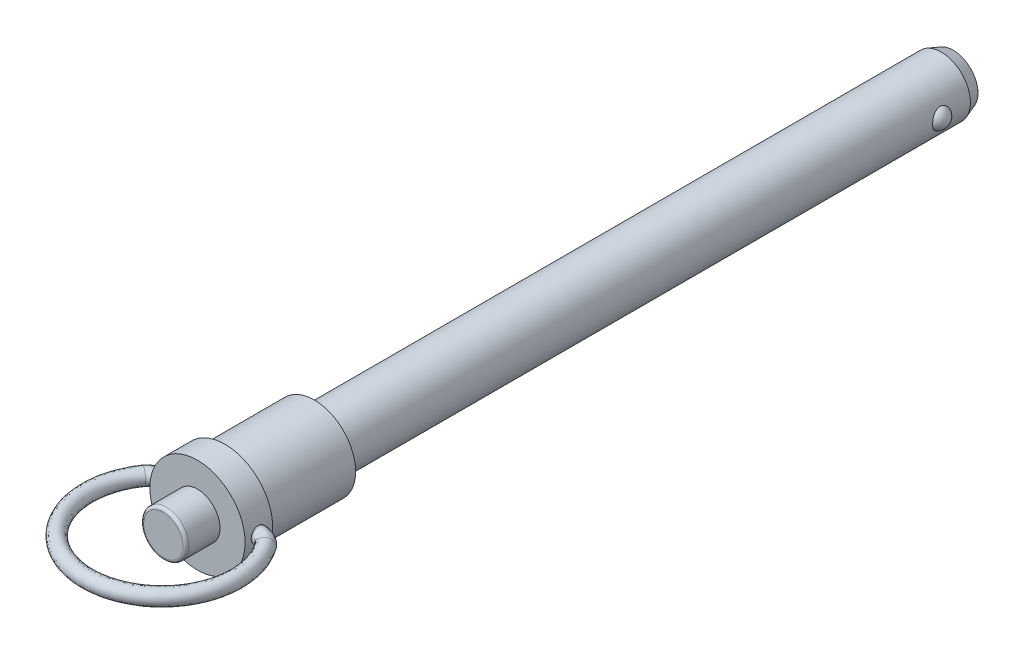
ISO-10303-21;
HEADER;
FILE_DESCRIPTION(('STEP AP214'),'2;1');
FILE_NAME('part.step','',(''),(''),'','','');
FILE_SCHEMA(('AUTOMOTIVE_DESIGN { 1 0 10303 214 1 1 1 1 }'));
ENDSEC;
DATA;
#1=APPLICATION_CONTEXT('core data for automotive mechanical design processes');
#2=APPLICATION_PROTOCOL_DEFINITION('international standard','automotive_design',2000,#1);
#3=PRODUCT_CONTEXT('',#1,'mechanical');
#4=PRODUCT('Part','Part','',(#3));
#5=PRODUCT_RELATED_PRODUCT_CATEGORY('part','',(#4));
#6=PRODUCT_DEFINITION_FORMATION('','',#4);
#7=PRODUCT_DEFINITION_CONTEXT('part definition',#1,'design');
#8=PRODUCT_DEFINITION('design','',#6,#7);
#9=PRODUCT_DEFINITION_SHAPE('','',#8);
#10=(LENGTH_UNIT() NAMED_UNIT(*) SI_UNIT(.MILLI.,.METRE.));
#11=(NAMED_UNIT(*) PLANE_ANGLE_UNIT() SI_UNIT($,.RADIAN.));
#12=(NAMED_UNIT(*) SI_UNIT($,.STERADIAN.) SOLID_ANGLE_UNIT());
#13=UNCERTAINTY_MEASURE_WITH_UNIT(LENGTH_MEASURE(1.E-05),#10,'distance_accuracy_value','');
#14=(GEOMETRIC_REPRESENTATION_CONTEXT(3) GLOBAL_UNCERTAINTY_ASSIGNED_CONTEXT((#13)) GLOBAL_UNIT_ASSIGNED_CONTEXT((#10,
#11,#12)) REPRESENTATION_CONTEXT('',''));
#15=CARTESIAN_POINT('',(0.,0.,0.));
#16=DIRECTION('',(0.,0.,1.));
#17=DIRECTION('',(1.,0.,0.));
#18=AXIS2_PLACEMENT_3D('',#15,#16,#17);
#19=CARTESIAN_POINT('',(4.22992248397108,0.,-109.0106));
#20=DIRECTION('',(0.,0.,1.));
#21=DIRECTION('',(0.,-1.,0.));
#22=AXIS2_PLACEMENT_3D('',#19,#20,#21);
#23=PLANE('',#22);
#24=CARTESIAN_POINT('',(0.,0.,-109.010599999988));
#25=DIRECTION('',(0.,0.,1.));
#26=DIRECTION('',(0.,-1.,0.));
#27=AXIS2_PLACEMENT_3D('',#24,#25,#26);
#28=CIRCLE('',#27,4.22992248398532);
#29=CARTESIAN_POINT('',(0.,-4.22992248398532,-109.010599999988));
#30=VERTEX_POINT('',#29);
#31=EDGE_CURVE('E147',#30,#30,#28,.T.);
#32=ORIENTED_EDGE('',*,*,#31,.F.);
#33=EDGE_LOOP('',(#32));
#34=FACE_BOUND('',#33,.T.);
#35=ADVANCED_FACE('F13',(#34),#23,.F.);
#36=CARTESIAN_POINT('',(4.14528,0.,-102.1018));
#37=DIRECTION('',(0.,0.,1.));
#38=DIRECTION('',(1.,0.,0.));
#39=AXIS2_PLACEMENT_3D('',#36,#37,#38);
#40=SPHERICAL_SURFACE('',#39,1.78562);
#41=CARTESIAN_POINT('',(4.96951,0.,-100.51779125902));
#42=CARTESIAN_POINT('',(4.96950607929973,0.0989420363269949,-100.517793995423));
#43=CARTESIAN_POINT('',(4.96652601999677,0.19797240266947,-100.525541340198));
#44=CARTESIAN_POINT('',(4.9548871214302,0.393364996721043,-100.556457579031));
#45=CARTESIAN_POINT('',(4.94621961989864,0.489722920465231,-100.579649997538));
#46=CARTESIAN_POINT('',(4.92409154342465,0.676928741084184,-100.641155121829));
#47=CARTESIAN_POINT('',(4.91063084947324,0.767776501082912,-100.679468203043));
#48=CARTESIAN_POINT('',(4.88035492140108,0.941233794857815,-100.770631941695));
#49=CARTESIAN_POINT('',(4.86354066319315,1.02384571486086,-100.82347837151));
#50=CARTESIAN_POINT('',(4.82872838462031,1.1770723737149,-100.941899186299));
#51=CARTESIAN_POINT('',(4.81075207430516,1.24784944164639,-101.007269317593));
#52=CARTESIAN_POINT('',(4.77554803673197,1.37645403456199,-101.149908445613));
#53=CARTESIAN_POINT('',(4.75832009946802,1.43428521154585,-101.227174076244));
#54=CARTESIAN_POINT('',(4.72780678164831,1.53177669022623,-101.386808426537));
#55=CARTESIAN_POINT('',(4.71434983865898,1.57230137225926,-101.468615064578));
#56=CARTESIAN_POINT('',(4.69186742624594,1.63818072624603,-101.638687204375));
#57=CARTESIAN_POINT('',(4.68283895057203,1.66354569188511,-101.726948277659));
#58=CARTESIAN_POINT('',(4.67098363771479,1.69653228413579,-101.899450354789));
#59=CARTESIAN_POINT('',(4.66770209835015,1.70545809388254,-101.983412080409));
#60=CARTESIAN_POINT('',(4.66631401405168,1.70925445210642,-102.15168455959));
#61=CARTESIAN_POINT('',(4.66820594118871,1.70412915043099,-102.23599520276));
#62=CARTESIAN_POINT('',(4.67672634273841,1.68059540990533,-102.398543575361));
#63=CARTESIAN_POINT('',(4.68313557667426,1.66280143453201,-102.476883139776));
#64=CARTESIAN_POINT('',(4.69974058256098,1.61527018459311,-102.62940562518));
#65=CARTESIAN_POINT('',(4.70993669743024,1.58553182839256,-102.703588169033));
#66=CARTESIAN_POINT('',(4.73339939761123,1.51406854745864,-102.848101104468));
#67=CARTESIAN_POINT('',(4.74674458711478,1.47202873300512,-102.918263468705));
#68=CARTESIAN_POINT('',(4.76791353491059,1.40129782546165,-103.017682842));
#69=CARTESIAN_POINT('',(4.77516406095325,1.37643370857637,-103.049860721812));
#70=CARTESIAN_POINT('',(4.78988709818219,1.32429117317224,-103.112185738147));
#71=CARTESIAN_POINT('',(4.79735977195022,1.29701095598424,-103.142331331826));
#72=CARTESIAN_POINT('',(4.82096563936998,1.20759667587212,-103.233818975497));
#73=CARTESIAN_POINT('',(4.83719300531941,1.14140257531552,-103.291246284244));
#74=CARTESIAN_POINT('',(4.86827537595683,1.00055962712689,-103.395051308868));
#75=CARTESIAN_POINT('',(4.88312976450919,0.925907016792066,-103.441424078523));
#76=CARTESIAN_POINT('',(4.90385674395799,0.806241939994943,-103.503673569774));
#77=CARTESIAN_POINT('',(4.91070233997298,0.763519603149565,-103.523725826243));
#78=CARTESIAN_POINT('',(4.92344025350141,0.676535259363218,-103.56038626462));
#79=CARTESIAN_POINT('',(4.92933338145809,0.632274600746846,-103.576997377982));
#80=CARTESIAN_POINT('',(4.94535278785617,0.497629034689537,-103.621573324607));
#81=CARTESIAN_POINT('',(4.95384366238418,0.405242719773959,-103.644351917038));
#82=CARTESIAN_POINT('',(4.96296311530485,0.260199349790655,-103.668602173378));
#83=CARTESIAN_POINT('',(4.96541051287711,0.208410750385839,-103.675049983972));
#84=CARTESIAN_POINT('',(4.96868499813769,0.104422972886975,-103.68365401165));
#85=CARTESIAN_POINT('',(4.96951206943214,0.0522237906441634,-103.685810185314));
#86=CARTESIAN_POINT('',(4.96950607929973,-0.0989420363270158,-103.685806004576));
#87=CARTESIAN_POINT('',(4.96652601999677,-0.197972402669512,-103.678058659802));
#88=CARTESIAN_POINT('',(4.9548871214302,-0.393364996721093,-103.647142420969));
#89=CARTESIAN_POINT('',(4.94621961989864,-0.48972292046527,-103.623950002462));
#90=CARTESIAN_POINT('',(4.92409154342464,-0.676928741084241,-103.562444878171));
#91=CARTESIAN_POINT('',(4.91063084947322,-0.767776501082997,-103.524131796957));
#92=CARTESIAN_POINT('',(4.88035492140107,-0.941233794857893,-103.432968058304));
#93=CARTESIAN_POINT('',(4.86354066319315,-1.02384571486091,-103.38012162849));
#94=CARTESIAN_POINT('',(4.82872838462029,-1.17707237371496,-103.261700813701));
#95=CARTESIAN_POINT('',(4.81075207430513,-1.24784944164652,-103.196330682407));
#96=CARTESIAN_POINT('',(4.77554803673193,-1.37645403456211,-103.053691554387));
#97=CARTESIAN_POINT('',(4.758320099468,-1.4342852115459,-102.976425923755));
#98=CARTESIAN_POINT('',(4.7278067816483,-1.53177669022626,-102.816791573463));
#99=CARTESIAN_POINT('',(4.71434983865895,-1.57230137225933,-102.734984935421));
#100=CARTESIAN_POINT('',(4.69186742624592,-1.6381807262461,-102.564912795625));
#101=CARTESIAN_POINT('',(4.68283895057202,-1.66354569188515,-102.476651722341));
#102=CARTESIAN_POINT('',(4.6709836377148,-1.6965322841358,-102.304149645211));
#103=CARTESIAN_POINT('',(4.66770209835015,-1.70545809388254,-102.220187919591));
#104=CARTESIAN_POINT('',(4.66631401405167,-1.70925445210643,-102.051915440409));
#105=CARTESIAN_POINT('',(4.6682059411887,-1.70412915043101,-101.96760479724));
#106=CARTESIAN_POINT('',(4.67672634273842,-1.68059540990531,-101.805056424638));
#107=CARTESIAN_POINT('',(4.68313557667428,-1.66280143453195,-101.726716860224));
#108=CARTESIAN_POINT('',(4.69974058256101,-1.61527018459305,-101.57419437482));
#109=CARTESIAN_POINT('',(4.70993669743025,-1.58553182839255,-101.500011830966));
#110=CARTESIAN_POINT('',(4.73339939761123,-1.51406854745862,-101.355498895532));
#111=CARTESIAN_POINT('',(4.7467445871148,-1.47202873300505,-101.285336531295));
#112=CARTESIAN_POINT('',(4.76791353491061,-1.40129782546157,-101.185917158));
#113=CARTESIAN_POINT('',(4.77516406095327,-1.37643370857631,-101.153739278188));
#114=CARTESIAN_POINT('',(4.7898870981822,-1.32429117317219,-101.091414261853));
#115=CARTESIAN_POINT('',(4.79735977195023,-1.29701095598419,-101.061268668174));
#116=CARTESIAN_POINT('',(4.82096563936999,-1.20759667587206,-100.969781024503));
#117=CARTESIAN_POINT('',(4.83719300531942,-1.14140257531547,-100.912353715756));
#118=CARTESIAN_POINT('',(4.86827537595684,-1.00055962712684,-100.808548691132));
#119=CARTESIAN_POINT('',(4.8831297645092,-0.925907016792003,-100.762175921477));
#120=CARTESIAN_POINT('',(4.903856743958,-0.806241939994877,-100.699926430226));
#121=CARTESIAN_POINT('',(4.91070233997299,-0.763519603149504,-100.679874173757));
#122=CARTESIAN_POINT('',(4.92344025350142,-0.676535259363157,-100.64321373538));
#123=CARTESIAN_POINT('',(4.9293333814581,-0.632274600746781,-100.626602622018));
#124=CARTESIAN_POINT('',(4.94535278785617,-0.497629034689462,-100.582026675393));
#125=CARTESIAN_POINT('',(4.95384366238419,-0.405242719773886,-100.559248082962));
#126=CARTESIAN_POINT('',(4.96296311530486,-0.260199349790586,-100.534997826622));
#127=CARTESIAN_POINT('',(4.96541051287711,-0.208410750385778,-100.528550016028));
#128=CARTESIAN_POINT('',(4.96868499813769,-0.104422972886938,-100.51994598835));
#129=CARTESIAN_POINT('',(4.96951206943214,-0.0522237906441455,-100.517789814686));
#130=CARTESIAN_POINT('',(4.96951,0.,-100.51779125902));
#131=B_SPLINE_CURVE_WITH_KNOTS('',3,(#41,#42,#43,#44,#45,#46,#47,#48,#49,#50,#51,#52,#53,#54,
#55,#56,#57,#58,#59,#60,#61,#62,#63,#64,#65,#66,#67,#68,#69,#70,#71,#72,#73,#74,#75,#76,#77,#78,
#79,#80,#81,#82,#83,#84,#85,#86,#87,#88,#89,#90,#91,#92,#93,#94,#95,#96,#97,#98,#99,#100,#101,
#102,#103,#104,#105,#106,#107,#108,#109,#110,#111,#112,#113,#114,#115,#116,#117,#118,#119,#120,
#121,#122,#123,#124,#125,#126,#127,#128,#129,#130),.UNSPECIFIED.,.T.,.F.,(4,2,2,2,2,2,2,2,2,2,2,
2,2,2,2,2,2,2,2,2,2,2,2,2,2,2,2,2,2,2,2,2,2,2,2,2,2,2,2,2,2,2,2,2,4),(0.,0.296633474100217,
0.593719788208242,0.890813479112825,1.18782083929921,1.4803431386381,1.77278281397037,
2.04813279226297,2.32329559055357,2.57549318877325,2.82761631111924,3.06827754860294,
3.30896058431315,3.55644296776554,3.68025851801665,3.8041670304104,4.07032015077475,
4.33659213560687,4.47951069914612,4.62230700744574,4.90743385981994,5.06400197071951,
5.22057166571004,5.5172051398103,5.81429145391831,6.11138514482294,6.4083925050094,
6.7009148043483,6.99335447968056,7.26870445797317,7.54386725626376,7.79606485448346,
8.04818797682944,8.28884921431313,8.52953225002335,8.77701463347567,8.90083018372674,
9.02473869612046,9.2908918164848,9.55716380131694,9.70008236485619,9.84287867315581,
10.12800552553,10.2845736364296,10.44114333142),.UNSPECIFIED.);
#132=CARTESIAN_POINT('',(4.96951,0.,-100.51779125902));
#133=VERTEX_POINT('',#132);
#134=EDGE_CURVE('E31',#133,#133,#131,.T.);
#135=ORIENTED_EDGE('',*,*,#134,.F.);
#136=EDGE_LOOP('',(#135));
#137=FACE_BOUND('',#136,.T.);
#138=ADVANCED_FACE('F132',(#137),#40,.T.);
#139=CARTESIAN_POINT('',(-4.14274,0.,-102.1018));
#140=DIRECTION('',(0.,0.,1.));
#141=DIRECTION('',(1.,0.,0.));
#142=AXIS2_PLACEMENT_3D('',#139,#140,#141);
#143=SPHERICAL_SURFACE('',#142,1.78562);
#144=CARTESIAN_POINT('',(-4.96951,0.,-103.684484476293));
#145=CARTESIAN_POINT('',(-4.96950608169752,0.0989139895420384,-103.684481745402));
#146=CARTESIAN_POINT('',(-4.96652771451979,0.197916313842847,-103.676737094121));
#147=CARTESIAN_POINT('',(-4.95489537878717,0.393254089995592,-103.645831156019));
#148=CARTESIAN_POINT('',(-4.94623274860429,0.489585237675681,-103.622646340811));
#149=CARTESIAN_POINT('',(-4.92411699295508,0.676739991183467,-103.561159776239));
#150=CARTESIAN_POINT('',(-4.91066371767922,0.767563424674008,-103.52285755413));
#151=CARTESIAN_POINT('',(-4.8804046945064,0.940973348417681,-103.431716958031));
#152=CARTESIAN_POINT('',(-4.86359992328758,1.02356222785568,-103.378882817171));
#153=CARTESIAN_POINT('',(-4.82881079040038,1.17673191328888,-103.260494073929));
#154=CARTESIAN_POINT('',(-4.81084830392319,1.24747651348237,-103.195145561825));
#155=CARTESIAN_POINT('',(-4.77567379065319,1.37601594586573,-103.052551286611));
#156=CARTESIAN_POINT('',(-4.75846155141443,1.43381446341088,-102.975308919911));
#157=CARTESIAN_POINT('',(-4.72798568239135,1.53122269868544,-102.815748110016));
#158=CARTESIAN_POINT('',(-4.71454945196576,1.57170168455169,-102.73399470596));
#159=CARTESIAN_POINT('',(-4.6921065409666,1.6374947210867,-102.564035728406));
#160=CARTESIAN_POINT('',(-4.68309684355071,1.66281910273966,-102.475834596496));
#161=CARTESIAN_POINT('',(-4.67127565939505,1.69572762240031,-102.303478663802));
#162=CARTESIAN_POINT('',(-4.66800833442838,1.70461968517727,-102.219603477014));
#163=CARTESIAN_POINT('',(-4.66664096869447,1.70836155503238,-102.051509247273));
#164=CARTESIAN_POINT('',(-4.66853940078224,1.70321551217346,-101.967290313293));
#165=CARTESIAN_POINT('',(-4.67706392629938,1.67965578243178,-101.804928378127));
#166=CARTESIAN_POINT('',(-4.68347088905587,1.66185668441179,-101.726683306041));
#167=CARTESIAN_POINT('',(-4.7000634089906,1.61433052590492,-101.574348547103));
#168=CARTESIAN_POINT('',(-4.7102493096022,1.58460238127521,-101.500259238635));
#169=CARTESIAN_POINT('',(-4.73368609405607,1.51317152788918,-101.355921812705));
#170=CARTESIAN_POINT('',(-4.74701574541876,1.47115297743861,-101.285842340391));
#171=CARTESIAN_POINT('',(-4.76815825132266,1.4004646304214,-101.186542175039));
#172=CARTESIAN_POINT('',(-4.77539944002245,1.37561647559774,-101.154403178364));
#173=CARTESIAN_POINT('',(-4.79010305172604,1.32350942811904,-101.092153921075));
#174=CARTESIAN_POINT('',(-4.7975656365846,1.29624874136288,-101.062045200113));
#175=CARTESIAN_POINT('',(-4.82114242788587,1.20688876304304,-100.970656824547));
#176=CARTESIAN_POINT('',(-4.83735008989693,1.14073361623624,-100.913289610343));
#177=CARTESIAN_POINT('',(-4.8683937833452,0.999979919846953,-100.809594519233));
#178=CARTESIAN_POINT('',(-4.88322919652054,0.925377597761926,-100.763271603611));
#179=CARTESIAN_POINT('',(-4.90393144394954,0.805786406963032,-100.701083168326));
#180=CARTESIAN_POINT('',(-4.91076989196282,0.763083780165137,-100.681047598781));
#181=CARTESIAN_POINT('',(-4.92349428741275,0.676140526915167,-100.644418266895));
#182=CARTESIAN_POINT('',(-4.92938104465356,0.631901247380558,-100.62782157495));
#183=CARTESIAN_POINT('',(-4.94538285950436,0.497321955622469,-100.583285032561));
#184=CARTESIAN_POINT('',(-4.95386398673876,0.404982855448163,-100.560527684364));
#185=CARTESIAN_POINT('',(-4.96297201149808,0.260022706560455,-100.536302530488));
#186=CARTESIAN_POINT('',(-4.96541608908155,0.208269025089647,-100.529862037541));
#187=CARTESIAN_POINT('',(-4.96868612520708,0.104351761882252,-100.521267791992));
#188=CARTESIAN_POINT('',(-4.96951206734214,0.0521881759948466,-100.519114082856));
#189=CARTESIAN_POINT('',(-4.96950608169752,-0.0989139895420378,-100.519118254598));
#190=CARTESIAN_POINT('',(-4.96652771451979,-0.197916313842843,-100.526862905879));
#191=CARTESIAN_POINT('',(-4.95489537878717,-0.393254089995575,-100.557768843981));
#192=CARTESIAN_POINT('',(-4.94623274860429,-0.489585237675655,-100.580953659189));
#193=CARTESIAN_POINT('',(-4.92411699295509,-0.67673999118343,-100.642440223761));
#194=CARTESIAN_POINT('',(-4.91066371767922,-0.767563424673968,-100.68074244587));
#195=CARTESIAN_POINT('',(-4.8804046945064,-0.940973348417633,-100.771883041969));
#196=CARTESIAN_POINT('',(-4.86359992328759,-1.02356222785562,-100.824717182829));
#197=CARTESIAN_POINT('',(-4.8288107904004,-1.17673191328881,-100.943105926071));
#198=CARTESIAN_POINT('',(-4.81084830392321,-1.24747651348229,-101.008454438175));
#199=CARTESIAN_POINT('',(-4.77567379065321,-1.37601594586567,-101.151048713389));
#200=CARTESIAN_POINT('',(-4.75846155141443,-1.43381446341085,-101.228291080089));
#201=CARTESIAN_POINT('',(-4.72798568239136,-1.53122269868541,-101.387851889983));
#202=CARTESIAN_POINT('',(-4.71454945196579,-1.57170168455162,-101.46960529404));
#203=CARTESIAN_POINT('',(-4.69210654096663,-1.63749472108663,-101.639564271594));
#204=CARTESIAN_POINT('',(-4.68309684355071,-1.66281910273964,-101.727765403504));
#205=CARTESIAN_POINT('',(-4.67127565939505,-1.69572762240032,-101.900121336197));
#206=CARTESIAN_POINT('',(-4.66800833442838,-1.70461968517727,-101.983996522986));
#207=CARTESIAN_POINT('',(-4.66664096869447,-1.70836155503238,-102.152090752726));
#208=CARTESIAN_POINT('',(-4.66853940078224,-1.70321551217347,-102.236309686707));
#209=CARTESIAN_POINT('',(-4.67706392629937,-1.6796557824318,-102.398671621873));
#210=CARTESIAN_POINT('',(-4.68347088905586,-1.66185668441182,-102.476916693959));
#211=CARTESIAN_POINT('',(-4.70006340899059,-1.61433052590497,-102.629251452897));
#212=CARTESIAN_POINT('',(-4.71024930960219,-1.58460238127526,-102.703340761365));
#213=CARTESIAN_POINT('',(-4.73368609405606,-1.51317152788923,-102.847678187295));
#214=CARTESIAN_POINT('',(-4.74701574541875,-1.47115297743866,-102.917757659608));
#215=CARTESIAN_POINT('',(-4.76815825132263,-1.4004646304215,-103.017057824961));
#216=CARTESIAN_POINT('',(-4.77539944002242,-1.37561647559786,-103.049196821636));
#217=CARTESIAN_POINT('',(-4.79010305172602,-1.32350942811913,-103.111446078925));
#218=CARTESIAN_POINT('',(-4.79756563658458,-1.29624874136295,-103.141554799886));
#219=CARTESIAN_POINT('',(-4.82114242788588,-1.20688876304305,-103.232943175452));
#220=CARTESIAN_POINT('',(-4.83735008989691,-1.14073361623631,-103.290310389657));
#221=CARTESIAN_POINT('',(-4.86839378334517,-0.999979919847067,-103.394005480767));
#222=CARTESIAN_POINT('',(-4.88322919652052,-0.925377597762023,-103.440328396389));
#223=CARTESIAN_POINT('',(-4.90393144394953,-0.805786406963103,-103.502516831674));
#224=CARTESIAN_POINT('',(-4.91076989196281,-0.763083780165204,-103.522552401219));
#225=CARTESIAN_POINT('',(-4.92349428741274,-0.676140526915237,-103.559181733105));
#226=CARTESIAN_POINT('',(-4.92938104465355,-0.631901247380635,-103.57577842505));
#227=CARTESIAN_POINT('',(-4.94538285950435,-0.497321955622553,-103.620314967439));
#228=CARTESIAN_POINT('',(-4.95386398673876,-0.404982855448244,-103.643072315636));
#229=CARTESIAN_POINT('',(-4.96297201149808,-0.260022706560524,-103.667297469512));
#230=CARTESIAN_POINT('',(-4.96541608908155,-0.208269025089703,-103.673737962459));
#231=CARTESIAN_POINT('',(-4.96868612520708,-0.104351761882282,-103.682332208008));
#232=CARTESIAN_POINT('',(-4.96951206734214,-0.0521881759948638,-103.684485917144));
#233=CARTESIAN_POINT('',(-4.96951,0.,-103.684484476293));
#234=B_SPLINE_CURVE_WITH_KNOTS('',3,(#144,#145,#146,#147,#148,#149,#150,#151,#152,#153,#154,
#155,#156,#157,#158,#159,#160,#161,#162,#163,#164,#165,#166,#167,#168,#169,#170,#171,#172,#173,
#174,#175,#176,#177,#178,#179,#180,#181,#182,#183,#184,#185,#186,#187,#188,#189,#190,#191,#192,
#193,#194,#195,#196,#197,#198,#199,#200,#201,#202,#203,#204,#205,#206,#207,#208,#209,#210,#211,
#212,#213,#214,#215,#216,#217,#218,#219,#220,#221,#222,#223,#224,#225,#226,#227,#228,#229,#230,
#231,#232,#233),.UNSPECIFIED.,.T.,.F.,(4,2,2,2,2,2,2,2,2,2,2,2,2,2,2,2,2,2,2,2,2,2,2,2,2,2,2,2,
2,2,2,2,2,2,2,2,2,2,2,2,2,2,2,2,4),(0.,0.296549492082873,0.593551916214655,0.890563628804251,
1.18748891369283,1.47988990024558,1.77220754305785,2.04734712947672,2.32229893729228,
2.57422747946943,2.8260815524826,3.06647154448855,3.30688338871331,3.55411689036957,
3.67780799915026,3.80159187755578,4.06753268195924,4.33359272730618,4.47643431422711,
4.61915370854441,4.90412739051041,5.06058877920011,5.21705175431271,5.51360124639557,
5.81060367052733,6.10761538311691,6.40454066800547,6.69694165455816,6.98925929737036,
7.26439888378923,7.53935069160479,7.79127923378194,8.04313330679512,8.28352329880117,
8.523935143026,8.77116864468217,8.89485975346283,9.01864363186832,9.28458443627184,
9.55064448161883,9.69348606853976,9.83620546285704,10.121179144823,10.2776405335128,
10.4341035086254),.UNSPECIFIED.);
#235=CARTESIAN_POINT('',(-4.96951,0.,-103.684484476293));
#236=VERTEX_POINT('',#235);
#237=EDGE_CURVE('E8',#236,#236,#234,.T.);
#238=ORIENTED_EDGE('',*,*,#237,.F.);
#239=EDGE_LOOP('',(#238));
#240=FACE_BOUND('',#239,.T.);
#241=ADVANCED_FACE('F45',(#240),#143,.T.);
#242=CARTESIAN_POINT('',(0.,0.,-106.978600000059));
#243=DIRECTION('',(0.,0.,1.));
#244=DIRECTION('',(0.,-1.,0.));
#245=AXIS2_PLACEMENT_3D('',#242,#243,#244);
#246=CONICAL_SURFACE('',#245,4.96950999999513,0.349065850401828);
#247=ORIENTED_EDGE('',*,*,#31,.T.);
#248=EDGE_LOOP('',(#247));
#249=FACE_BOUND('',#248,.T.);
#250=CARTESIAN_POINT('',(0.,0.,-106.9786));
#251=DIRECTION('',(0.,0.,1.));
#252=DIRECTION('',(0.,-1.,0.));
#253=AXIS2_PLACEMENT_3D('',#250,#251,#252);
#254=CIRCLE('',#253,4.96951);
#255=CARTESIAN_POINT('',(0.,-4.96951,-106.9786));
#256=VERTEX_POINT('',#255);
#257=EDGE_CURVE('E26',#256,#256,#254,.T.);
#258=ORIENTED_EDGE('',*,*,#257,.F.);
#259=EDGE_LOOP('',(#258));
#260=FACE_BOUND('',#259,.T.);
#261=ADVANCED_FACE('F55',(#249,#260),#246,.T.);
#262=CARTESIAN_POINT('',(0.,0.,-75.));
#263=DIRECTION('',(0.,0.,1.));
#264=DIRECTION('',(-0.810321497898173,-0.585985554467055,0.));
#265=AXIS2_PLACEMENT_3D('',#262,#263,#264);
#266=CYLINDRICAL_SURFACE('',#265,4.96951);
#267=CARTESIAN_POINT('',(0.,0.,0.));
#268=DIRECTION('',(0.,0.,-1.));
#269=DIRECTION('',(0.,1.,0.));
#270=AXIS2_PLACEMENT_3D('',#267,#268,#269);
#271=CIRCLE('',#270,4.96951);
#272=CARTESIAN_POINT('',(0.,4.96951000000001,0.));
#273=VERTEX_POINT('',#272);
#274=EDGE_CURVE('E144',#273,#273,#271,.T.);
#275=ORIENTED_EDGE('',*,*,#274,.T.);
#276=EDGE_LOOP('',(#275));
#277=FACE_BOUND('',#276,.T.);
#278=ORIENTED_EDGE('',*,*,#257,.T.);
#279=EDGE_LOOP('',(#278));
#280=FACE_BOUND('',#279,.T.);
#281=ORIENTED_EDGE('',*,*,#237,.T.);
#282=EDGE_LOOP('',(#281));
#283=FACE_BOUND('',#282,.T.);
#284=ORIENTED_EDGE('',*,*,#134,.T.);
#285=EDGE_LOOP('',(#284));
#286=FACE_BOUND('',#285,.T.);
#287=ADVANCED_FACE('F50',(#277,#280,#283,#286),#266,.T.);
#288=CARTESIAN_POINT('',(0.,0.,25.765));
#289=DIRECTION('',(0.,0.,1.));
#290=DIRECTION('',(1.,0.,0.));
#291=AXIS2_PLACEMENT_3D('',#288,#289,#290);
#292=PLANE('',#291);
#293=CARTESIAN_POINT('',(0.,0.,25.765));
#294=DIRECTION('',(0.,0.,1.));
#295=DIRECTION('',(1.,0.,0.));
#296=AXIS2_PLACEMENT_3D('',#293,#294,#295);
#297=CIRCLE('',#296,3.3481);
#298=CARTESIAN_POINT('',(3.3481,0.,25.765));
#299=VERTEX_POINT('',#298);
#300=EDGE_CURVE('E163',#299,#299,#297,.T.);
#301=ORIENTED_EDGE('',*,*,#300,.T.);
#302=EDGE_LOOP('',(#301));
#303=FACE_BOUND('',#302,.T.);
#304=ADVANCED_FACE('F54',(#303),#292,.T.);
#305=CARTESIAN_POINT('',(0.,0.,25.265));
#306=DIRECTION('',(0.,0.,1.));
#307=DIRECTION('',(1.,0.,0.));
#308=AXIS2_PLACEMENT_3D('',#305,#306,#307);
#309=TOROIDAL_SURFACE('',#308,3.3481,0.5);
#310=CARTESIAN_POINT('',(0.,0.,25.265));
#311=DIRECTION('',(0.,0.,1.));
#312=DIRECTION('',(1.,0.,0.));
#313=AXIS2_PLACEMENT_3D('',#310,#311,#312);
#314=CIRCLE('',#313,3.8481);
#315=CARTESIAN_POINT('',(3.8481,0.,25.265));
#316=VERTEX_POINT('',#315);
#317=EDGE_CURVE('E168',#316,#316,#314,.T.);
#318=ORIENTED_EDGE('',*,*,#317,.T.);
#319=EDGE_LOOP('',(#318));
#320=FACE_BOUND('',#319,.T.);
#321=ORIENTED_EDGE('',*,*,#300,.F.);
#322=EDGE_LOOP('',(#321));
#323=FACE_BOUND('',#322,.T.);
#324=ADVANCED_FACE('F77',(#320,#323),#309,.T.);
#325=CARTESIAN_POINT('',(11.4497733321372,0.,17.9437724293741));
#326=CARTESIAN_POINT('',(11.8265676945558,0.,18.4801460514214));
#327=CARTESIAN_POINT('',(12.6551080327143,0.,19.8662433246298));
#328=CARTESIAN_POINT('',(13.4882796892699,0.,22.0133244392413));
#329=CARTESIAN_POINT('',(14.0014195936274,0.,24.4938075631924));
#330=CARTESIAN_POINT('',(14.0399868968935,0.,27.1482100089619));
#331=CARTESIAN_POINT('',(13.5501253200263,0.,29.8733661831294));
#332=CARTESIAN_POINT('',(12.5103672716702,0.,32.4943169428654));
#333=CARTESIAN_POINT('',(10.9649059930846,0.,34.8529407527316));
#334=CARTESIAN_POINT('',(9.01915526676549,0.,36.8217510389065));
#335=CARTESIAN_POINT('',(6.82219687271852,0.,38.3176313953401));
#336=CARTESIAN_POINT('',(4.51156788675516,0.,39.3254677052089));
#337=CARTESIAN_POINT('',(2.23137128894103,0.,39.879227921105));
#338=CARTESIAN_POINT('',(7.28333001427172E-13,0.,40.0580345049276));
#339=CARTESIAN_POINT('',(-2.23137128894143,0.,39.879227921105));
#340=CARTESIAN_POINT('',(-4.51156788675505,0.,39.3254677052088));
#341=CARTESIAN_POINT('',(-6.82219687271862,0.,38.31763139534));
#342=CARTESIAN_POINT('',(-9.01915526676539,0.,36.8217510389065));
#343=CARTESIAN_POINT('',(-10.9649059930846,0.,34.8529407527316));
#344=CARTESIAN_POINT('',(-12.5103672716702,0.,32.4943169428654));
#345=CARTESIAN_POINT('',(-13.5501253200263,0.,29.8733661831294));
#346=CARTESIAN_POINT('',(-14.0399868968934,0.,27.148210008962));
#347=CARTESIAN_POINT('',(-14.0014195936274,0.,24.4938075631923));
#348=CARTESIAN_POINT('',(-13.4882796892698,0.,22.0133244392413));
#349=CARTESIAN_POINT('',(-12.6551080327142,0.,19.8662433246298));
#350=CARTESIAN_POINT('',(-11.8265676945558,0.,18.4801460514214));
#351=CARTESIAN_POINT('',(-11.4497733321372,0.,17.9437724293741));
#352=CARTESIAN_POINT('',(11.4497733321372,-2.59999999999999,17.9437724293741));
#353=CARTESIAN_POINT('',(11.7096770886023,-2.59999999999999,18.3137501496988));
#354=CARTESIAN_POINT('',(12.7137877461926,-2.59999999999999,19.9497749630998));
#355=CARTESIAN_POINT('',(13.4708176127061,-2.59999999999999,21.9884668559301));
#356=CARTESIAN_POINT('',(14.0065482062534,-2.6,24.5011082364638));
#357=CARTESIAN_POINT('',(14.0385176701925,-2.59999999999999,27.1461185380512));
#358=CARTESIAN_POINT('',(13.5505344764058,-2.59999999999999,29.8739486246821));
#359=CARTESIAN_POINT('',(12.5102566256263,-2.59999999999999,32.4941594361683));
#360=CARTESIAN_POINT('',(10.9649350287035,-2.59999999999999,34.8529820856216));
#361=CARTESIAN_POINT('',(9.01914786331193,-2.6,36.8217404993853));
#362=CARTESIAN_POINT('',(6.82219870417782,-2.59999999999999,38.3176340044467));
#363=CARTESIAN_POINT('',(4.51156744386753,-2.59999999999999,39.3254670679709));
#364=CARTESIAN_POINT('',(2.23137138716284,-2.59999999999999,39.879228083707));
#365=CARTESIAN_POINT('',(7.28268272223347E-13,-2.59999999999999,40.0580344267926));
#366=CARTESIAN_POINT('',(-2.23137138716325,-2.6,39.879228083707));
#367=CARTESIAN_POINT('',(-4.51156744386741,-2.59999999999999,39.3254670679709));
#368=CARTESIAN_POINT('',(-6.82219870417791,-2.6,38.3176340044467));
#369=CARTESIAN_POINT('',(-9.01914786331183,-2.59999999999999,36.8217404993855));
#370=CARTESIAN_POINT('',(-10.9649350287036,-2.59999999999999,34.8529820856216));
#371=CARTESIAN_POINT('',(-12.5102566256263,-2.59999999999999,32.4941594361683));
#372=CARTESIAN_POINT('',(-13.5505344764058,-2.59999999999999,29.8739486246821));
#373=CARTESIAN_POINT('',(-14.0385176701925,-2.6,27.1461185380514));
#374=CARTESIAN_POINT('',(-14.0065482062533,-2.59999999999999,24.5011082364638));
#375=CARTESIAN_POINT('',(-13.4708176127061,-2.59999999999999,21.9884668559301));
#376=CARTESIAN_POINT('',(-12.7137877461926,-2.59999999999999,19.9497749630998));
#377=CARTESIAN_POINT('',(-11.7096770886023,-2.59999999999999,18.3137501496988));
#378=CARTESIAN_POINT('',(-11.4497733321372,-2.59999999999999,17.9437724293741));
#379=CARTESIAN_POINT('',(9.33442519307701,-2.59999999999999,19.4556422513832));
#380=CARTESIAN_POINT('',(9.59432894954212,-2.59999999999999,19.8256199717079));
#381=CARTESIAN_POINT('',(10.3328710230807,-2.59999999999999,21.0505437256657));
#382=CARTESIAN_POINT('',(10.9823054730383,-2.59999999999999,22.7644201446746));
#383=CARTESIAN_POINT('',(11.4042672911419,-2.6,24.7888114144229));
#384=CARTESIAN_POINT('',(11.4306312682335,-2.59999999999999,26.9493701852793));
#385=CARTESIAN_POINT('',(11.0308912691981,-2.59999999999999,29.1626260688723));
#386=CARTESIAN_POINT('',(10.1828123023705,-2.59999999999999,31.2968985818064));
#387=CARTESIAN_POINT('',(8.92160036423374,-2.59999999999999,33.2166725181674));
#388=CARTESIAN_POINT('',(7.34098330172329,-2.6,34.8144779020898));
#389=CARTESIAN_POINT('',(5.5491258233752,-2.59999999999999,36.0332448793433));
#390=CARTESIAN_POINT('',(3.67550207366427,-2.59999999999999,36.8497543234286));
#391=CARTESIAN_POINT('',(1.8109997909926,-2.59999999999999,37.3021941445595));
#392=CARTESIAN_POINT('',(-9.61358135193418E-13,-2.59999999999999,37.4469985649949));
#393=CARTESIAN_POINT('',(-1.81099979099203,-2.6,37.3021941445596));
#394=CARTESIAN_POINT('',(-3.6755020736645,-2.59999999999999,36.8497543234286));
#395=CARTESIAN_POINT('',(-5.54912582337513,-2.6,36.0332448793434));
#396=CARTESIAN_POINT('',(-7.34098330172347,-2.59999999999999,34.8144779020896));
#397=CARTESIAN_POINT('',(-8.92160036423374,-2.59999999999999,33.2166725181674));
#398=CARTESIAN_POINT('',(-10.1828123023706,-2.59999999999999,31.2968985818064));
#399=CARTESIAN_POINT('',(-11.0308912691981,-2.59999999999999,29.1626260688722));
#400=CARTESIAN_POINT('',(-11.4306312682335,-2.6,26.9493701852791));
#401=CARTESIAN_POINT('',(-11.4042672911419,-2.59999999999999,24.7888114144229));
#402=CARTESIAN_POINT('',(-10.9823054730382,-2.59999999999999,22.7644201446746));
#403=CARTESIAN_POINT('',(-10.3328710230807,-2.59999999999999,21.0505437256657));
#404=CARTESIAN_POINT('',(-9.59432894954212,-2.59999999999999,19.8256199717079));
#405=CARTESIAN_POINT('',(-9.33442519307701,-2.59999999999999,19.4556422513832));
#406=CARTESIAN_POINT('',(9.33442519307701,0.,19.4556422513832));
#407=CARTESIAN_POINT('',(9.65277425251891,0.,19.9088179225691));
#408=CARTESIAN_POINT('',(10.3035311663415,0.,21.0087779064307));
#409=CARTESIAN_POINT('',(10.9910365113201,0.,22.7768489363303));
#410=CARTESIAN_POINT('',(11.4017029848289,0.,24.7851610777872));
#411=CARTESIAN_POINT('',(11.431365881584,0.,26.9504159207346));
#412=CARTESIAN_POINT('',(11.0306866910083,0.,29.1623348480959));
#413=CARTESIAN_POINT('',(10.1828676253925,0.,31.2969773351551));
#414=CARTESIAN_POINT('',(8.92158584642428,0.,33.2166518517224));
#415=CARTESIAN_POINT('',(7.34098700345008,0.,34.8144831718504));
#416=CARTESIAN_POINT('',(5.54912490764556,0.,36.03324357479));
#417=CARTESIAN_POINT('',(3.67550229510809,0.,36.8497546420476));
#418=CARTESIAN_POINT('',(1.8109997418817,0.,37.3021940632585));
#419=CARTESIAN_POINT('',(-9.6127182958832E-13,0.,37.4469986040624));
#420=CARTESIAN_POINT('',(-1.81099974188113,0.,37.3021940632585));
#421=CARTESIAN_POINT('',(-3.67550229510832,0.,36.8497546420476));
#422=CARTESIAN_POINT('',(-5.54912490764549,0.,36.03324357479));
#423=CARTESIAN_POINT('',(-7.34098700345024,0.,34.8144831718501));
#424=CARTESIAN_POINT('',(-8.92158584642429,0.,33.2166518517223));
#425=CARTESIAN_POINT('',(-10.1828676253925,0.,31.296977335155));
#426=CARTESIAN_POINT('',(-11.0306866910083,0.,29.1623348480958));
#427=CARTESIAN_POINT('',(-11.431365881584,0.,26.9504159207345));
#428=CARTESIAN_POINT('',(-11.4017029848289,0.,24.7851610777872));
#429=CARTESIAN_POINT('',(-10.9910365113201,0.,22.7768489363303));
#430=CARTESIAN_POINT('',(-10.3035311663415,0.,21.0087779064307));
#431=CARTESIAN_POINT('',(-9.6527742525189,0.,19.9088179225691));
#432=CARTESIAN_POINT('',(-9.33442519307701,0.,19.4556422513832));
#433=CARTESIAN_POINT('',(9.33442519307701,2.59999999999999,19.4556422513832));
#434=CARTESIAN_POINT('',(9.7112195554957,2.59999999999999,19.9920158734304));
#435=CARTESIAN_POINT('',(10.2741913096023,2.59999999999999,20.9670120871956));
#436=CARTESIAN_POINT('',(10.999767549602,2.59999999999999,22.7892777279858));
#437=CARTESIAN_POINT('',(11.3991386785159,2.6,24.7815107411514));
#438=CARTESIAN_POINT('',(11.4321004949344,2.59999999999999,26.9514616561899));
#439=CARTESIAN_POINT('',(11.0304821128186,2.59999999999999,29.1620436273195));
#440=CARTESIAN_POINT('',(10.1829229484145,2.59999999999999,31.2970560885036));
#441=CARTESIAN_POINT('',(8.92157132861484,2.59999999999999,33.2166311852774));
#442=CARTESIAN_POINT('',(7.34099070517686,2.6,34.8144884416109));
#443=CARTESIAN_POINT('',(5.54912399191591,2.59999999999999,36.0332422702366));
#444=CARTESIAN_POINT('',(3.67550251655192,2.59999999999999,36.8497549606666));
#445=CARTESIAN_POINT('',(1.81099969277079,2.59999999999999,37.3021939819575));
#446=CARTESIAN_POINT('',(-9.61422864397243E-13,2.59999999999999,37.4469986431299));
#447=CARTESIAN_POINT('',(-1.81099969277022,2.6,37.3021939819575));
#448=CARTESIAN_POINT('',(-3.67550251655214,2.59999999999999,36.8497549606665));
#449=CARTESIAN_POINT('',(-5.54912399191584,2.6,36.0332422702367));
#450=CARTESIAN_POINT('',(-7.34099070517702,2.59999999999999,34.8144884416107));
#451=CARTESIAN_POINT('',(-8.92157132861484,2.59999999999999,33.2166311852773));
#452=CARTESIAN_POINT('',(-10.1829229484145,2.59999999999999,31.2970560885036));
#453=CARTESIAN_POINT('',(-11.0304821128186,2.59999999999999,29.1620436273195));
#454=CARTESIAN_POINT('',(-11.4321004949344,2.6,26.9514616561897));
#455=CARTESIAN_POINT('',(-11.3991386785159,2.59999999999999,24.7815107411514));
#456=CARTESIAN_POINT('',(-10.999767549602,2.59999999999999,22.7892777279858));
#457=CARTESIAN_POINT('',(-10.2741913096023,2.59999999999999,20.9670120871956));
#458=CARTESIAN_POINT('',(-9.71121955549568,2.59999999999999,19.9920158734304));
#459=CARTESIAN_POINT('',(-9.33442519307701,2.59999999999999,19.4556422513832));
#460=CARTESIAN_POINT('',(11.4497733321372,2.59999999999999,17.9437724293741));
#461=CARTESIAN_POINT('',(11.9434583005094,2.59999999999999,18.6465419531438));
#462=CARTESIAN_POINT('',(12.5964283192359,2.59999999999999,19.7827116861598));
#463=CARTESIAN_POINT('',(13.5057417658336,2.59999999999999,22.0381820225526));
#464=CARTESIAN_POINT('',(13.9962909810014,2.6,24.4865068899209));
#465=CARTESIAN_POINT('',(14.0414561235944,2.59999999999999,27.1503014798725));
#466=CARTESIAN_POINT('',(13.5497161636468,2.59999999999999,29.8727837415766));
#467=CARTESIAN_POINT('',(12.5104779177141,2.59999999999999,32.4944744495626));
#468=CARTESIAN_POINT('',(10.9648769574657,2.59999999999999,34.8528994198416));
#469=CARTESIAN_POINT('',(9.01916267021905,2.6,36.8217615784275));
#470=CARTESIAN_POINT('',(6.82219504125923,2.59999999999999,38.3176287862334));
#471=CARTESIAN_POINT('',(4.5115683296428,2.59999999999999,39.3254683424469));
#472=CARTESIAN_POINT('',(2.23137119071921,2.59999999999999,39.8792277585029));
#473=CARTESIAN_POINT('',(7.28203543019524E-13,2.59999999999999,40.0580345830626));
#474=CARTESIAN_POINT('',(-2.23137119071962,2.6,39.879227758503));
#475=CARTESIAN_POINT('',(-4.51156832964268,2.59999999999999,39.3254683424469));
#476=CARTESIAN_POINT('',(-6.82219504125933,2.6,38.3176287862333));
#477=CARTESIAN_POINT('',(-9.01916267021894,2.59999999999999,36.8217615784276));
#478=CARTESIAN_POINT('',(-10.9648769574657,2.59999999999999,34.8528994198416));
#479=CARTESIAN_POINT('',(-12.5104779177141,2.59999999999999,32.4944744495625));
#480=CARTESIAN_POINT('',(-13.5497161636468,2.59999999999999,29.8727837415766));
#481=CARTESIAN_POINT('',(-14.0414561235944,2.6,27.1503014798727));
#482=CARTESIAN_POINT('',(-13.9962909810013,2.59999999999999,24.4865068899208));
#483=CARTESIAN_POINT('',(-13.5057417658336,2.59999999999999,22.0381820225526));
#484=CARTESIAN_POINT('',(-12.5964283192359,2.59999999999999,19.7827116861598));
#485=CARTESIAN_POINT('',(-11.9434583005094,2.59999999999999,18.6465419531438));
#486=CARTESIAN_POINT('',(-11.4497733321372,2.59999999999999,17.9437724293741));
#487=CARTESIAN_POINT('',(11.4497733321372,0.,17.9437724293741));
#488=CARTESIAN_POINT('',(11.8265676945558,0.,18.4801460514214));
#489=CARTESIAN_POINT('',(12.6551080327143,0.,19.8662433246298));
#490=CARTESIAN_POINT('',(13.4882796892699,0.,22.0133244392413));
#491=CARTESIAN_POINT('',(14.0014195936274,0.,24.4938075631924));
#492=CARTESIAN_POINT('',(14.0399868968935,0.,27.1482100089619));
#493=CARTESIAN_POINT('',(13.5501253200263,0.,29.8733661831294));
#494=CARTESIAN_POINT('',(12.5103672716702,0.,32.4943169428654));
#495=CARTESIAN_POINT('',(10.9649059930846,0.,34.8529407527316));
#496=CARTESIAN_POINT('',(9.01915526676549,0.,36.8217510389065));
#497=CARTESIAN_POINT('',(6.82219687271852,0.,38.3176313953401));
#498=CARTESIAN_POINT('',(4.51156788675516,0.,39.3254677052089));
#499=CARTESIAN_POINT('',(2.23137128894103,0.,39.879227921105));
#500=CARTESIAN_POINT('',(7.28333001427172E-13,0.,40.0580345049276));
#501=CARTESIAN_POINT('',(-2.23137128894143,0.,39.879227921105));
#502=CARTESIAN_POINT('',(-4.51156788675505,0.,39.3254677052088));
#503=CARTESIAN_POINT('',(-6.82219687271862,0.,38.31763139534));
#504=CARTESIAN_POINT('',(-9.01915526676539,0.,36.8217510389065));
#505=CARTESIAN_POINT('',(-10.9649059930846,0.,34.8529407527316));
#506=CARTESIAN_POINT('',(-12.5103672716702,0.,32.4943169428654));
#507=CARTESIAN_POINT('',(-13.5501253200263,0.,29.8733661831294));
#508=CARTESIAN_POINT('',(-14.0399868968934,0.,27.148210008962));
#509=CARTESIAN_POINT('',(-14.0014195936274,0.,24.4938075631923));
#510=CARTESIAN_POINT('',(-13.4882796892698,0.,22.0133244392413));
#511=CARTESIAN_POINT('',(-12.6551080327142,0.,19.8662433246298));
#512=CARTESIAN_POINT('',(-11.8265676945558,0.,18.4801460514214));
#513=CARTESIAN_POINT('',(-11.4497733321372,0.,17.9437724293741));
#514=(BOUNDED_SURFACE() B_SPLINE_SURFACE(3,3,((#325,#326,#327,#328,#329,#330,#331,#332,#333,
#334,#335,#336,#337,#338,#339,#340,#341,#342,#343,#344,#345,#346,#347,#348,#349,#350,#351),
(#352,#353,#354,#355,#356,#357,#358,#359,#360,#361,#362,#363,#364,#365,#366,#367,#368,#369,#370,
#371,#372,#373,#374,#375,#376,#377,#378),(#379,#380,#381,#382,#383,#384,#385,#386,#387,#388,
#389,#390,#391,#392,#393,#394,#395,#396,#397,#398,#399,#400,#401,#402,#403,#404,#405),(#406,
#407,#408,#409,#410,#411,#412,#413,#414,#415,#416,#417,#418,#419,#420,#421,#422,#423,#424,#425,
#426,#427,#428,#429,#430,#431,#432),(#433,#434,#435,#436,#437,#438,#439,#440,#441,#442,#443,
#444,#445,#446,#447,#448,#449,#450,#451,#452,#453,#454,#455,#456,#457,#458,#459),(#460,#461,
#462,#463,#464,#465,#466,#467,#468,#469,#470,#471,#472,#473,#474,#475,#476,#477,#478,#479,#480,
#481,#482,#483,#484,#485,#486),(#487,#488,#489,#490,#491,#492,#493,#494,#495,#496,#497,#498,
#499,#500,#501,#502,#503,#504,#505,#506,#507,#508,#509,#510,#511,#512,#513)),.UNSPECIFIED.,.T.,
.F.,.F.) B_SPLINE_SURFACE_WITH_KNOTS((4,3,4),(4,1,1,1,1,1,1,1,1,1,1,1,1,1,1,1,1,1,1,1,1,1,1,1,
4),(0.,0.5,1.),(0.,0.0355177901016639,0.0739139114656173,0.114982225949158,0.158533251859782,
0.203808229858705,0.250000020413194,0.296191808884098,0.34146678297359,0.385017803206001,
0.426086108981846,0.464482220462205,0.5,0.535517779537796,0.573913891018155,0.614982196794,
0.658533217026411,0.703808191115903,0.749999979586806,0.796191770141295,0.841466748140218,
0.885017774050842,0.926086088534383,0.964482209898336,1.),
.UNSPECIFIED.) GEOMETRIC_REPRESENTATION_ITEM() RATIONAL_B_SPLINE_SURFACE(((1.,1.,1.,1.,1.,1.,1.,
1.,1.,1.,1.,1.,1.,1.,1.,1.,1.,1.,1.,1.,1.,1.,1.,1.,1.,1.,1.),(0.333333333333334,
0.333333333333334,0.333333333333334,0.333333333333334,0.333333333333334,0.333333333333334,
0.333333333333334,0.333333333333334,0.333333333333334,0.333333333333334,0.333333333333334,
0.333333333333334,0.333333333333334,0.333333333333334,0.333333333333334,0.333333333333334,
0.333333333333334,0.333333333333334,0.333333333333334,0.333333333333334,0.333333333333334,
0.333333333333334,0.333333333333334,0.333333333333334,0.333333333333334,0.333333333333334,
0.333333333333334),(0.333333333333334,0.333333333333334,0.333333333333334,0.333333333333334,
0.333333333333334,0.333333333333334,0.333333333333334,0.333333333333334,0.333333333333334,
0.333333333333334,0.333333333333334,0.333333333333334,0.333333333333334,0.333333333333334,
0.333333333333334,0.333333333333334,0.333333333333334,0.333333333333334,0.333333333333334,
0.333333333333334,0.333333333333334,0.333333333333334,0.333333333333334,0.333333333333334,
0.333333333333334,0.333333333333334,0.333333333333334),(1.,1.,1.,1.,1.,1.,1.,1.,1.,1.,1.,1.,1.,
1.,1.,1.,1.,1.,1.,1.,1.,1.,1.,1.,1.,1.,1.),(0.333333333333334,0.333333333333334,
0.333333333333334,0.333333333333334,0.333333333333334,0.333333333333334,0.333333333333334,
0.333333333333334,0.333333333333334,0.333333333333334,0.333333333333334,0.333333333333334,
0.333333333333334,0.333333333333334,0.333333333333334,0.333333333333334,0.333333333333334,
0.333333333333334,0.333333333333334,0.333333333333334,0.333333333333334,0.333333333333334,
0.333333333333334,0.333333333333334,0.333333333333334,0.333333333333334,0.333333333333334),
(0.333333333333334,0.333333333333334,0.333333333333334,0.333333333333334,0.333333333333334,
0.333333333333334,0.333333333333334,0.333333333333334,0.333333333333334,0.333333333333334,
0.333333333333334,0.333333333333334,0.333333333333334,0.333333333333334,0.333333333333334,
0.333333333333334,0.333333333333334,0.333333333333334,0.333333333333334,0.333333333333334,
0.333333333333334,0.333333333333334,0.333333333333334,0.333333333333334,0.333333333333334,
0.333333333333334,0.333333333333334),(1.,1.,1.,1.,1.,1.,1.,1.,1.,1.,1.,1.,1.,1.,1.,1.,1.,1.,1.,
1.,1.,1.,1.,1.,1.,1.,1.))) REPRESENTATION_ITEM('') SURFACE());
#515=CARTESIAN_POINT('',(11.4497733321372,0.,17.9437724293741));
#516=CARTESIAN_POINT('',(11.4497733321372,-2.59999999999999,17.9437724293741));
#517=CARTESIAN_POINT('',(9.33442519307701,-2.59999999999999,19.4556422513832));
#518=CARTESIAN_POINT('',(9.33442519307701,0.,19.4556422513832));
#519=CARTESIAN_POINT('',(9.33442519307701,2.59999999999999,19.4556422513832));
#520=CARTESIAN_POINT('',(11.4497733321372,2.59999999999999,17.9437724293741));
#521=CARTESIAN_POINT('',(11.4497733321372,0.,17.9437724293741));
#522=(BOUNDED_CURVE() B_SPLINE_CURVE(3,(#515,#516,#517,#518,#519,#520,#521),.UNSPECIFIED.,.T.,
.F.) B_SPLINE_CURVE_WITH_KNOTS((4,3,4),(0.,0.5,1.),
.UNSPECIFIED.) CURVE() GEOMETRIC_REPRESENTATION_ITEM() RATIONAL_B_SPLINE_CURVE((1.,
0.333333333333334,0.333333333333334,1.,0.333333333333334,0.333333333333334,1.)) REPRESENTATION_ITEM(''));
#523=CARTESIAN_POINT('',(11.4497733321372,0.,17.9437724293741));
#524=VERTEX_POINT('',#523);
#525=EDGE_CURVE('E181',#524,#524,#522,.T.);
#526=CARTESIAN_POINT('',(-11.4497733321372,0.,17.9437724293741));
#527=CARTESIAN_POINT('',(-11.4497733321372,-2.59999999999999,17.9437724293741));
#528=CARTESIAN_POINT('',(-9.33442519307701,-2.59999999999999,19.4556422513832));
#529=CARTESIAN_POINT('',(-9.33442519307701,0.,19.4556422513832));
#530=CARTESIAN_POINT('',(-9.33442519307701,2.59999999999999,19.4556422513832));
#531=CARTESIAN_POINT('',(-11.4497733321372,2.59999999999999,17.9437724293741));
#532=CARTESIAN_POINT('',(-11.4497733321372,0.,17.9437724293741));
#533=(BOUNDED_CURVE() B_SPLINE_CURVE(3,(#526,#527,#528,#529,#530,#531,#532),.UNSPECIFIED.,.T.,
.F.) B_SPLINE_CURVE_WITH_KNOTS((4,3,4),(0.,0.5,1.),
.UNSPECIFIED.) CURVE() GEOMETRIC_REPRESENTATION_ITEM() RATIONAL_B_SPLINE_CURVE((1.,
0.333333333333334,0.333333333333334,1.,0.333333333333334,0.333333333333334,1.)) REPRESENTATION_ITEM(''));
#534=CARTESIAN_POINT('',(-11.4497733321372,0.,17.9437724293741));
#535=VERTEX_POINT('',#534);
#536=EDGE_CURVE('E176',#535,#535,#533,.F.);
#537=ORIENTED_EDGE('',*,*,#525,.F.);
#538=EDGE_LOOP('',(#537));
#539=FACE_BOUND('',#538,.T.);
#540=ORIENTED_EDGE('',*,*,#536,.F.);
#541=EDGE_LOOP('',(#540));
#542=FACE_BOUND('',#541,.T.);
#543=ADVANCED_FACE('F66',(#539,#542),#514,.F.);
#544=CARTESIAN_POINT('',(8.23717073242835,0.,16.3022));
#545=CARTESIAN_POINT('',(8.39026579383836,0.,16.3022));
#546=CARTESIAN_POINT('',(8.96971374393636,0.,16.3453113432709));
#547=CARTESIAN_POINT('',(9.59211406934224,0.,16.5211040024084));
#548=CARTESIAN_POINT('',(10.3031381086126,0.,16.8555507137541));
#549=CARTESIAN_POINT('',(10.8955792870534,0.,17.2786190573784));
#550=CARTESIAN_POINT('',(11.3434296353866,0.,17.7975125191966));
#551=CARTESIAN_POINT('',(11.4497733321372,0.,17.9437724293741));
#552=CARTESIAN_POINT('',(8.23717073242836,2.59999999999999,16.3022));
#553=CARTESIAN_POINT('',(8.16213736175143,2.59999999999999,16.3022));
#554=CARTESIAN_POINT('',(9.0792865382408,2.59999999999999,16.3469383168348));
#555=CARTESIAN_POINT('',(9.55822083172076,2.6,16.5152316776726));
#556=CARTESIAN_POINT('',(10.3298909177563,2.59999999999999,16.879237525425));
#557=CARTESIAN_POINT('',(10.8172738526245,2.59999999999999,17.1748054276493));
#558=CARTESIAN_POINT('',(11.5008843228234,2.59999999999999,18.0140679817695));
#559=CARTESIAN_POINT('',(11.4497733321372,2.59999999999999,17.9437724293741));
#560=CARTESIAN_POINT('',(8.23717073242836,2.59999999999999,18.9022));
#561=CARTESIAN_POINT('',(8.16213736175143,2.59999999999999,18.9022));
#562=CARTESIAN_POINT('',(8.54034086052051,2.59999999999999,18.9167455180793));
#563=CARTESIAN_POINT('',(8.68812752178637,2.6,18.9762506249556));
#564=CARTESIAN_POINT('',(8.94759350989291,2.59999999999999,19.0969960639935));
#565=CARTESIAN_POINT('',(9.10292826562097,2.59999999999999,19.1770581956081));
#566=CARTESIAN_POINT('',(9.38553618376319,2.59999999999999,19.5259378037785));
#567=CARTESIAN_POINT('',(9.33442519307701,2.59999999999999,19.4556422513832));
#568=CARTESIAN_POINT('',(8.23717073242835,0.,18.9022));
#569=CARTESIAN_POINT('',(8.2762015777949,0.,18.9022));
#570=CARTESIAN_POINT('',(8.48555446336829,0.,18.9159320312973));
#571=CARTESIAN_POINT('',(8.70507414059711,0.,18.9791867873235));
#572=CARTESIAN_POINT('',(8.93421710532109,0.,19.0851526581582));
#573=CARTESIAN_POINT('',(9.14208098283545,0.,19.2289650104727));
#574=CARTESIAN_POINT('',(9.30680884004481,0.,19.4176600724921));
#575=CARTESIAN_POINT('',(9.33442519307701,0.,19.4556422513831));
#576=CARTESIAN_POINT('',(8.23717073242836,-2.59999999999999,18.9022));
#577=CARTESIAN_POINT('',(8.39026579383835,-2.59999999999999,18.9022));
#578=CARTESIAN_POINT('',(8.43076806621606,-2.59999999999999,18.9151185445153));
#579=CARTESIAN_POINT('',(8.72202075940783,-2.6,18.9821229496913));
#580=CARTESIAN_POINT('',(8.92084070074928,-2.59999999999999,19.0733092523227));
#581=CARTESIAN_POINT('',(9.1812337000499,-2.59999999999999,19.2808718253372));
#582=CARTESIAN_POINT('',(9.22808149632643,-2.59999999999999,19.3093823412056));
#583=CARTESIAN_POINT('',(9.33442519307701,-2.59999999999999,19.4556422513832));
#584=CARTESIAN_POINT('',(8.23717073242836,-2.59999999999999,16.3022));
#585=CARTESIAN_POINT('',(8.61839422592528,-2.59999999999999,16.3022));
#586=CARTESIAN_POINT('',(8.8601409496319,-2.59999999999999,16.3436843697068));
#587=CARTESIAN_POINT('',(9.6260073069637,-2.6,16.5269763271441));
#588=CARTESIAN_POINT('',(10.276385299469,-2.59999999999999,16.8318639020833));
#589=CARTESIAN_POINT('',(10.9738847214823,-2.59999999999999,17.3824326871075));
#590=CARTESIAN_POINT('',(11.1859749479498,-2.59999999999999,17.5809570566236));
#591=CARTESIAN_POINT('',(11.4497733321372,-2.59999999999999,17.9437724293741));
#592=CARTESIAN_POINT('',(8.23717073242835,0.,16.3022));
#593=CARTESIAN_POINT('',(8.39026579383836,0.,16.3022));
#594=CARTESIAN_POINT('',(8.96971374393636,0.,16.3453113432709));
#595=CARTESIAN_POINT('',(9.59211406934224,0.,16.5211040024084));
#596=CARTESIAN_POINT('',(10.3031381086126,0.,16.8555507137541));
#597=CARTESIAN_POINT('',(10.8955792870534,0.,17.2786190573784));
#598=CARTESIAN_POINT('',(11.3434296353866,0.,17.7975125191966));
#599=CARTESIAN_POINT('',(11.4497733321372,0.,17.9437724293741));
#600=(BOUNDED_SURFACE() B_SPLINE_SURFACE(3,3,((#544,#545,#546,#547,#548,#549,#550,#551),(#552,
#553,#554,#555,#556,#557,#558,#559),(#560,#561,#562,#563,#564,#565,#566,#567),(#568,#569,#570,
#571,#572,#573,#574,#575),(#576,#577,#578,#579,#580,#581,#582,#583),(#584,#585,#586,#587,#588,
#589,#590,#591),(#592,#593,#594,#595,#596,#597,#598,#599)),.UNSPECIFIED.,.T.,.F.,
.F.) B_SPLINE_SURFACE_WITH_KNOTS((4,3,4),(4,1,1,1,1,4),(0.,0.5,1.),(0.,0.183393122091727,
0.371127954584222,0.561360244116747,0.78346967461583,1.),
.UNSPECIFIED.) GEOMETRIC_REPRESENTATION_ITEM() RATIONAL_B_SPLINE_SURFACE(((1.,1.,1.,1.,1.,1.,1.,
1.),(0.333333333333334,0.333333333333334,0.333333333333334,0.333333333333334,0.333333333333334,
0.333333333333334,0.333333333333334,0.333333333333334),(0.333333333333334,0.333333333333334,
0.333333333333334,0.333333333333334,0.333333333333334,0.333333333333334,0.333333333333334,
0.333333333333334),(1.,1.,1.,1.,1.,1.,1.,1.),(0.333333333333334,0.333333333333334,
0.333333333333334,0.333333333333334,0.333333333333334,0.333333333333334,0.333333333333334,
0.333333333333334),(0.333333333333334,0.333333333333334,0.333333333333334,0.333333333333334,
0.333333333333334,0.333333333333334,0.333333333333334,0.333333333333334),(1.,1.,1.,1.,1.,1.,1.,1.))) REPRESENTATION_ITEM('') SURFACE());
#601=CARTESIAN_POINT('',(8.23717073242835,0.,17.6022));
#602=DIRECTION('',(1.,0.,0.));
#603=DIRECTION('',(0.,0.,-1.));
#604=AXIS2_PLACEMENT_3D('',#601,#602,#603);
#605=CIRCLE('',#604,1.3);
#606=CARTESIAN_POINT('',(8.23717073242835,0.,16.3022));
#607=VERTEX_POINT('',#606);
#608=EDGE_CURVE('E109',#607,#607,#605,.T.);
#609=ORIENTED_EDGE('',*,*,#608,.T.);
#610=EDGE_LOOP('',(#609));
#611=FACE_BOUND('',#610,.T.);
#612=ORIENTED_EDGE('',*,*,#525,.T.);
#613=EDGE_LOOP('',(#612));
#614=FACE_BOUND('',#613,.T.);
#615=ADVANCED_FACE('F76',(#611,#614),#600,.T.);
#616=CARTESIAN_POINT('',(0.,0.,24.765));
#617=DIRECTION('',(0.,0.,-1.));
#618=DIRECTION('',(0.,1.,0.));
#619=AXIS2_PLACEMENT_3D('',#616,#617,#618);
#620=CYLINDRICAL_SURFACE('',#619,3.8481);
#621=CARTESIAN_POINT('',(0.,0.,19.939));
#622=DIRECTION('',(0.,0.,-1.));
#623=DIRECTION('',(0.,1.,0.));
#624=AXIS2_PLACEMENT_3D('',#621,#622,#623);
#625=CIRCLE('',#624,3.8481);
#626=CARTESIAN_POINT('',(0.,3.8481,19.939));
#627=VERTEX_POINT('',#626);
#628=EDGE_CURVE('E160',#627,#627,#625,.T.);
#629=ORIENTED_EDGE('',*,*,#628,.F.);
#630=EDGE_LOOP('',(#629));
#631=FACE_BOUND('',#630,.T.);
#632=ORIENTED_EDGE('',*,*,#317,.F.);
#633=EDGE_LOOP('',(#632));
#634=FACE_BOUND('',#633,.T.);
#635=ADVANCED_FACE('F64',(#631,#634),#620,.T.);
#636=CARTESIAN_POINT('',(-11.4497733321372,0.,17.9437724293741));
#637=CARTESIAN_POINT('',(-11.3597411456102,0.,17.8199465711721));
#638=CARTESIAN_POINT('',(-10.985804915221,0.,17.3752654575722));
#639=CARTESIAN_POINT('',(-10.4784291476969,0.,16.9741029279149));
#640=CARTESIAN_POINT('',(-9.7908926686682,0.,16.5936956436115));
#641=CARTESIAN_POINT('',(-9.10089921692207,0.,16.3618307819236));
#642=CARTESIAN_POINT('',(-8.41800257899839,0.,16.3022));
#643=CARTESIAN_POINT('',(-8.23717073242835,0.,16.3022));
#644=CARTESIAN_POINT('',(-11.4497733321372,2.59999999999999,17.9437724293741));
#645=CARTESIAN_POINT('',(-11.4938947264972,2.59999999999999,18.0044548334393));
#646=CARTESIAN_POINT('',(-10.9200537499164,2.59999999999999,17.2876012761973));
#647=CARTESIAN_POINT('',(-10.503110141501,2.6,16.9980618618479));
#648=CARTESIAN_POINT('',(-9.75600116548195,2.59999999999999,16.585987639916));
#649=CARTESIAN_POINT('',(-9.23091765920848,2.59999999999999,16.3641146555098));
#650=CARTESIAN_POINT('',(-8.15024985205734,2.59999999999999,16.3022));
#651=CARTESIAN_POINT('',(-8.23717073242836,2.59999999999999,16.3022));
#652=CARTESIAN_POINT('',(-9.33442519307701,2.59999999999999,19.4556422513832));
#653=CARTESIAN_POINT('',(-9.37854658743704,2.59999999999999,19.5163246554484));
#654=CARTESIAN_POINT('',(-9.14268985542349,2.59999999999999,19.2203693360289));
#655=CARTESIAN_POINT('',(-9.00682479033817,2.6,19.1369648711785));
#656=CARTESIAN_POINT('',(-8.7554763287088,2.59999999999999,19.0001197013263));
#657=CARTESIAN_POINT('',(-8.59879927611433,2.59999999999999,18.9230559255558));
#658=CARTESIAN_POINT('',(-8.15024985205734,2.59999999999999,18.9022));
#659=CARTESIAN_POINT('',(-8.23717073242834,2.59999999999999,18.9022));
#660=CARTESIAN_POINT('',(-9.334425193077,0.,19.4556422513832));
#661=CARTESIAN_POINT('',(-9.31146979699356,0.,19.4240705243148));
#662=CARTESIAN_POINT('',(-9.17556543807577,0.,19.2642014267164));
#663=CARTESIAN_POINT('',(-8.99448429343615,0.,19.124985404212));
#664=CARTESIAN_POINT('',(-8.77292208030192,0.,19.0039737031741));
#665=CARTESIAN_POINT('',(-8.53379005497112,0.,18.9219139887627));
#666=CARTESIAN_POINT('',(-8.28412621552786,0.,18.9022));
#667=CARTESIAN_POINT('',(-8.23717073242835,0.,18.9022));
#668=CARTESIAN_POINT('',(-9.33442519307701,-2.59999999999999,19.4556422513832));
#669=CARTESIAN_POINT('',(-9.24439300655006,-2.59999999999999,19.3318163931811));
#670=CARTESIAN_POINT('',(-9.20844102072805,-2.59999999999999,19.3080335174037));
#671=CARTESIAN_POINT('',(-8.98214379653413,-2.6,19.1130059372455));
#672=CARTESIAN_POINT('',(-8.79036783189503,-2.59999999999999,19.0078277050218));
#673=CARTESIAN_POINT('',(-8.46878083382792,-2.59999999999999,18.9207720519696));
#674=CARTESIAN_POINT('',(-8.41800257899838,-2.59999999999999,18.9022));
#675=CARTESIAN_POINT('',(-8.23717073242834,-2.59999999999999,18.9022));
#676=CARTESIAN_POINT('',(-11.4497733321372,-2.59999999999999,17.9437724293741));
#677=CARTESIAN_POINT('',(-11.2255875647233,-2.59999999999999,17.6354383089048));
#678=CARTESIAN_POINT('',(-11.0515560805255,-2.59999999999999,17.4629296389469));
#679=CARTESIAN_POINT('',(-10.4537481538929,-2.6,16.9501439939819));
#680=CARTESIAN_POINT('',(-9.82578417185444,-2.59999999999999,16.6014036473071));
#681=CARTESIAN_POINT('',(-8.97088077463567,-2.59999999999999,16.3595469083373));
#682=CARTESIAN_POINT('',(-8.68575530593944,-2.59999999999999,16.3022));
#683=CARTESIAN_POINT('',(-8.23717073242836,-2.59999999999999,16.3022));
#684=CARTESIAN_POINT('',(-11.4497733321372,0.,17.9437724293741));
#685=CARTESIAN_POINT('',(-11.3597411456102,0.,17.8199465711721));
#686=CARTESIAN_POINT('',(-10.985804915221,0.,17.3752654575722));
#687=CARTESIAN_POINT('',(-10.4784291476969,0.,16.9741029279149));
#688=CARTESIAN_POINT('',(-9.7908926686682,0.,16.5936956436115));
#689=CARTESIAN_POINT('',(-9.10089921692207,0.,16.3618307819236));
#690=CARTESIAN_POINT('',(-8.41800257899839,0.,16.3022));
#691=CARTESIAN_POINT('',(-8.23717073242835,0.,16.3022));
#692=(BOUNDED_SURFACE() B_SPLINE_SURFACE(3,3,((#636,#637,#638,#639,#640,#641,#642,#643),(#644,
#645,#646,#647,#648,#649,#650,#651),(#652,#653,#654,#655,#656,#657,#658,#659),(#660,#661,#662,
#663,#664,#665,#666,#667),(#668,#669,#670,#671,#672,#673,#674,#675),(#676,#677,#678,#679,#680,
#681,#682,#683),(#684,#685,#686,#687,#688,#689,#690,#691)),.UNSPECIFIED.,.T.,.F.,
.F.) B_SPLINE_SURFACE_WITH_KNOTS((4,3,4),(4,1,1,1,1,4),(0.,0.5,1.),(0.,0.183394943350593,
0.371130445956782,0.561362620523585,0.783471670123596,1.),
.UNSPECIFIED.) GEOMETRIC_REPRESENTATION_ITEM() RATIONAL_B_SPLINE_SURFACE(((1.,1.,1.,1.,1.,1.,1.,
1.),(0.333333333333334,0.333333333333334,0.333333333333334,0.333333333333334,0.333333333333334,
0.333333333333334,0.333333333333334,0.333333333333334),(0.333333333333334,0.333333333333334,
0.333333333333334,0.333333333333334,0.333333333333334,0.333333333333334,0.333333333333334,
0.333333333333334),(1.,1.,1.,1.,1.,1.,1.,1.),(0.333333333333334,0.333333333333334,
0.333333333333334,0.333333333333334,0.333333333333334,0.333333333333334,0.333333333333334,
0.333333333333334),(0.333333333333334,0.333333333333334,0.333333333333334,0.333333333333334,
0.333333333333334,0.333333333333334,0.333333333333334,0.333333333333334),(1.,1.,1.,1.,1.,1.,1.,1.))) REPRESENTATION_ITEM('') SURFACE());
#693=CARTESIAN_POINT('',(-8.23717073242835,0.,17.6022));
#694=DIRECTION('',(-1.,0.,0.));
#695=DIRECTION('',(0.,0.,1.));
#696=AXIS2_PLACEMENT_3D('',#693,#694,#695);
#697=CIRCLE('',#696,1.3);
#698=CARTESIAN_POINT('',(-8.23717073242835,0.,18.9022));
#699=VERTEX_POINT('',#698);
#700=EDGE_CURVE('E189',#699,#699,#697,.T.);
#701=ORIENTED_EDGE('',*,*,#536,.T.);
#702=EDGE_LOOP('',(#701));
#703=FACE_BOUND('',#702,.T.);
#704=ORIENTED_EDGE('',*,*,#700,.T.);
#705=EDGE_LOOP('',(#704));
#706=FACE_BOUND('',#705,.T.);
#707=ADVANCED_FACE('F58',(#703,#706),#692,.T.);
#708=CARTESIAN_POINT('',(8.23717073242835,0.,17.6022));
#709=DIRECTION('',(-1.,0.,0.));
#710=DIRECTION('',(0.,0.,1.));
#711=AXIS2_PLACEMENT_3D('',#708,#709,#710);
#712=CYLINDRICAL_SURFACE('',#711,1.3);
#713=CARTESIAN_POINT('',(8.128,0.,18.9022));
#714=CARTESIAN_POINT('',(8.12799878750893,0.072525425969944,18.9021970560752));
#715=CARTESIAN_POINT('',(8.12701915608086,0.145091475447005,18.8961103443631));
#716=CARTESIAN_POINT('',(8.12320552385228,0.288191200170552,18.8719327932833));
#717=CARTESIAN_POINT('',(8.1203697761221,0.358722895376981,18.8538306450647));
#718=CARTESIAN_POINT('',(8.11316223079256,0.495662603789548,18.8061803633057));
#719=CARTESIAN_POINT('',(8.1087916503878,0.562073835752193,18.7766412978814));
#720=CARTESIAN_POINT('',(8.09899598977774,0.688988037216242,18.706978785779));
#721=CARTESIAN_POINT('',(8.09357104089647,0.749491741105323,18.6668566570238));
#722=CARTESIAN_POINT('',(8.08221522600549,0.863417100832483,18.5767896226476));
#723=CARTESIAN_POINT('',(8.07628069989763,0.916778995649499,18.5267695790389));
#724=CARTESIAN_POINT('',(8.06460286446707,1.01439001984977,18.4184883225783));
#725=CARTESIAN_POINT('',(8.05885956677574,1.05863859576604,18.3602266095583));
#726=CARTESIAN_POINT('',(8.04817900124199,1.1370036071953,18.2367090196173));
#727=CARTESIAN_POINT('',(8.04324646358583,1.17106147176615,18.1714155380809));
#728=CARTESIAN_POINT('',(8.03479635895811,1.22770383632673,18.0359425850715));
#729=CARTESIAN_POINT('',(8.03127870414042,1.25028904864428,17.9657634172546));
#730=CARTESIAN_POINT('',(8.02609290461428,1.28315781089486,17.8231426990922));
#731=CARTESIAN_POINT('',(8.02440930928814,1.29354418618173,17.7507254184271));
#732=CARTESIAN_POINT('',(8.02303544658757,1.30203914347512,17.6051578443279));
#733=CARTESIAN_POINT('',(8.02334504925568,1.30014852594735,17.532007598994));
#734=CARTESIAN_POINT('',(8.02590848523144,1.28422703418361,17.3877813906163));
#735=CARTESIAN_POINT('',(8.02814388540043,1.27031125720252,17.3166923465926));
#736=CARTESIAN_POINT('',(8.03427821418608,1.23091490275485,17.1778712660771));
#737=CARTESIAN_POINT('',(8.03817719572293,1.20543395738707,17.110139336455));
#738=CARTESIAN_POINT('',(8.04721946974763,1.14351263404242,16.9796082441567));
#739=CARTESIAN_POINT('',(8.0523682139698,1.10702406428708,16.9168323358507));
#740=CARTESIAN_POINT('',(8.06332603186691,1.02415752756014,16.7982506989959));
#741=CARTESIAN_POINT('',(8.06913515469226,0.977778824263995,16.7424454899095));
#742=CARTESIAN_POINT('',(8.08084037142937,0.875819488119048,16.6387227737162));
#743=CARTESIAN_POINT('',(8.08673670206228,0.820140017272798,16.5909023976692));
#744=CARTESIAN_POINT('',(8.09789065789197,0.701495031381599,16.5052692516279));
#745=CARTESIAN_POINT('',(8.10314827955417,0.638529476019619,16.467456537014));
#746=CARTESIAN_POINT('',(8.11243904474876,0.507011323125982,16.402904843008));
#747=CARTESIAN_POINT('',(8.11647128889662,0.438454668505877,16.3761739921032));
#748=CARTESIAN_POINT('',(8.1228496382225,0.297746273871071,16.3346325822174));
#749=CARTESIAN_POINT('',(8.12519587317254,0.225594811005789,16.3198211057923));
#750=CARTESIAN_POINT('',(8.12792050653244,0.0805825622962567,16.3026695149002));
#751=CARTESIAN_POINT('',(8.12831995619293,0.00773793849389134,16.3001959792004));
#752=CARTESIAN_POINT('',(8.12716352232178,-0.137325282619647,16.3074354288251));
#753=CARTESIAN_POINT('',(8.12560770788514,-0.209543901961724,16.3171479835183));
#754=CARTESIAN_POINT('',(8.12072858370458,-0.350896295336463,16.3483729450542));
#755=CARTESIAN_POINT('',(8.11741510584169,-0.420044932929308,16.3698197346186));
#756=CARTESIAN_POINT('',(8.10939080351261,-0.553765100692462,16.4238347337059));
#757=CARTESIAN_POINT('',(8.10467990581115,-0.61833639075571,16.4564035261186));
#758=CARTESIAN_POINT('',(8.09433146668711,-0.741651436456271,16.5320466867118));
#759=CARTESIAN_POINT('',(8.08868664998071,-0.800343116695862,16.5752049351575));
#760=CARTESIAN_POINT('',(8.07711967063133,-0.909698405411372,16.67068593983));
#761=CARTESIAN_POINT('',(8.0711974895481,-0.960361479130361,16.7230093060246));
#762=CARTESIAN_POINT('',(8.05967572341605,-1.05271221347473,16.8359318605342));
#763=CARTESIAN_POINT('',(8.05407973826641,-1.09431001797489,16.896604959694));
#764=CARTESIAN_POINT('',(8.04390974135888,-1.16672309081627,17.024155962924));
#765=CARTESIAN_POINT('',(8.03933569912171,-1.19753868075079,17.0910336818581));
#766=CARTESIAN_POINT('',(8.03175410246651,-1.24737615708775,17.2288373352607));
#767=CARTESIAN_POINT('',(8.02874047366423,-1.26644383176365,17.2997463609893));
#768=CARTESIAN_POINT('',(8.02460529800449,-1.29238901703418,17.4438126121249));
#769=CARTESIAN_POINT('',(8.02348360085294,-1.29926749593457,17.5169696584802));
#770=CARTESIAN_POINT('',(8.02326541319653,-1.30061367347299,17.6625587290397));
#771=CARTESIAN_POINT('',(8.0241458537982,-1.29522274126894,17.7349894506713));
#772=CARTESIAN_POINT('',(8.02778235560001,-1.27248767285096,17.8778995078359));
#773=CARTESIAN_POINT('',(8.03053841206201,-1.25514356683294,17.9483788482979));
#774=CARTESIAN_POINT('',(8.03760713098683,-1.20904693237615,18.0853372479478));
#775=CARTESIAN_POINT('',(8.04191826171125,-1.18030562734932,18.1518201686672));
#776=CARTESIAN_POINT('',(8.0516130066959,-1.11224476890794,18.2790433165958));
#777=CARTESIAN_POINT('',(8.05699666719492,-1.07292475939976,18.3397832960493));
#778=CARTESIAN_POINT('',(8.06830344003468,-0.984314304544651,18.4545123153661));
#779=CARTESIAN_POINT('',(8.07423180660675,-0.934919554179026,18.508420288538));
#780=CARTESIAN_POINT('',(8.08591729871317,-0.827782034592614,18.6072314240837));
#781=CARTESIAN_POINT('',(8.09167438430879,-0.770037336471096,18.6521325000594));
#782=CARTESIAN_POINT('',(8.10241053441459,-0.647407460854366,18.7319120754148));
#783=CARTESIAN_POINT('',(8.10738445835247,-0.582479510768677,18.7667255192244));
#784=CARTESIAN_POINT('',(8.11594372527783,-0.447646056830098,18.8248990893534));
#785=CARTESIAN_POINT('',(8.11953047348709,-0.377745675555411,18.8482708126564));
#786=CARTESIAN_POINT('',(8.12411350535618,-0.25629650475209,18.8777288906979));
#787=CARTESIAN_POINT('',(8.12556327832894,-0.205488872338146,18.8868911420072));
#788=CARTESIAN_POINT('',(8.12750694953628,-0.103127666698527,18.8991276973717));
#789=CARTESIAN_POINT('',(8.1280008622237,-0.0515741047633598,18.9022020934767));
#790=CARTESIAN_POINT('',(8.128,0.,18.9022));
#791=B_SPLINE_CURVE_WITH_KNOTS('',3,(#713,#714,#715,#716,#717,#718,#719,#720,#721,#722,#723,
#724,#725,#726,#727,#728,#729,#730,#731,#732,#733,#734,#735,#736,#737,#738,#739,#740,#741,#742,
#743,#744,#745,#746,#747,#748,#749,#750,#751,#752,#753,#754,#755,#756,#757,#758,#759,#760,#761,
#762,#763,#764,#765,#766,#767,#768,#769,#770,#771,#772,#773,#774,#775,#776,#777,#778,#779,#780,
#781,#782,#783,#784,#785,#786,#787,#788,#789,#790),.UNSPECIFIED.,.T.,.F.,(4,2,2,2,2,2,2,2,2,2,2,
2,2,2,2,2,2,2,2,2,2,2,2,2,2,2,2,2,2,2,2,2,2,2,2,2,2,2,4),(0.,0.217387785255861,0.43498046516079,
0.652400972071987,0.869794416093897,1.08890626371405,1.30803141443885,1.52839280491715,
1.74874051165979,1.96721724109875,2.18567972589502,2.40207409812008,2.6184753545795,
2.83583812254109,3.05321707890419,3.27307317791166,3.49293049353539,3.71294878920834,
3.93295014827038,4.15056719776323,4.36817655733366,4.58458131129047,4.80099740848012,
5.01918647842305,5.23739007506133,5.45766698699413,5.67793732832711,5.89734362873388,
6.11673249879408,6.33360636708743,6.5504796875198,6.76713996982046,6.98380959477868,
7.2028480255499,7.42193713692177,7.64240922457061,7.86265738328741,8.01724799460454,
8.17183626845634),.UNSPECIFIED.);
#792=CARTESIAN_POINT('',(8.128,0.,18.9022));
#793=VERTEX_POINT('',#792);
#794=EDGE_CURVE('E17',#793,#793,#791,.T.);
#795=ORIENTED_EDGE('',*,*,#794,.F.);
#796=EDGE_LOOP('',(#795));
#797=FACE_BOUND('',#796,.T.);
#798=ORIENTED_EDGE('',*,*,#608,.F.);
#799=EDGE_LOOP('',(#798));
#800=FACE_BOUND('',#799,.T.);
#801=ADVANCED_FACE('F63',(#797,#800),#712,.T.);
#802=CARTESIAN_POINT('',(8.128,0.,19.939));
#803=DIRECTION('',(0.,0.,1.));
#804=DIRECTION('',(0.,-1.,0.));
#805=AXIS2_PLACEMENT_3D('',#802,#803,#804);
#806=PLANE('',#805);
#807=ORIENTED_EDGE('',*,*,#628,.T.);
#808=EDGE_LOOP('',(#807));
#809=FACE_BOUND('',#808,.T.);
#810=CARTESIAN_POINT('',(0.,0.,19.939));
#811=DIRECTION('',(0.,0.,-1.));
#812=DIRECTION('',(0.,1.,0.));
#813=AXIS2_PLACEMENT_3D('',#810,#811,#812);
#814=CIRCLE('',#813,8.128);
#815=CARTESIAN_POINT('',(0.,8.128,19.939));
#816=VERTEX_POINT('',#815);
#817=EDGE_CURVE('E157',#816,#816,#814,.T.);
#818=ORIENTED_EDGE('',*,*,#817,.F.);
#819=EDGE_LOOP('',(#818));
#820=FACE_BOUND('',#819,.T.);
#821=ADVANCED_FACE('F98',(#809,#820),#806,.T.);
#822=CARTESIAN_POINT('',(-8.128,0.,18.9022));
#823=CARTESIAN_POINT('',(-8.12799878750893,-0.072525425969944,18.9021970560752));
#824=CARTESIAN_POINT('',(-8.12701915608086,-0.145091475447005,18.8961103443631));
#825=CARTESIAN_POINT('',(-8.12320552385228,-0.288191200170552,18.8719327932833));
#826=CARTESIAN_POINT('',(-8.1203697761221,-0.358722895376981,18.8538306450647));
#827=CARTESIAN_POINT('',(-8.11316223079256,-0.495662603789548,18.8061803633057));
#828=CARTESIAN_POINT('',(-8.1087916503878,-0.562073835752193,18.7766412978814));
#829=CARTESIAN_POINT('',(-8.09899598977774,-0.688988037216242,18.706978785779));
#830=CARTESIAN_POINT('',(-8.09357104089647,-0.749491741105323,18.6668566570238));
#831=CARTESIAN_POINT('',(-8.08221522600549,-0.863417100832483,18.5767896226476));
#832=CARTESIAN_POINT('',(-8.07628069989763,-0.916778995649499,18.5267695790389));
#833=CARTESIAN_POINT('',(-8.06460286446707,-1.01439001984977,18.4184883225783));
#834=CARTESIAN_POINT('',(-8.05885956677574,-1.05863859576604,18.3602266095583));
#835=CARTESIAN_POINT('',(-8.04817900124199,-1.1370036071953,18.2367090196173));
#836=CARTESIAN_POINT('',(-8.04324646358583,-1.17106147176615,18.1714155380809));
#837=CARTESIAN_POINT('',(-8.03479635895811,-1.22770383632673,18.0359425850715));
#838=CARTESIAN_POINT('',(-8.03127870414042,-1.25028904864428,17.9657634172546));
#839=CARTESIAN_POINT('',(-8.02609290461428,-1.28315781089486,17.8231426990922));
#840=CARTESIAN_POINT('',(-8.02440930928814,-1.29354418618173,17.7507254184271));
#841=CARTESIAN_POINT('',(-8.02303544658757,-1.30203914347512,17.6051578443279));
#842=CARTESIAN_POINT('',(-8.02334504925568,-1.30014852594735,17.532007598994));
#843=CARTESIAN_POINT('',(-8.02590848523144,-1.28422703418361,17.3877813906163));
#844=CARTESIAN_POINT('',(-8.02814388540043,-1.27031125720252,17.3166923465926));
#845=CARTESIAN_POINT('',(-8.03427821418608,-1.23091490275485,17.1778712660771));
#846=CARTESIAN_POINT('',(-8.03817719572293,-1.20543395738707,17.110139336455));
#847=CARTESIAN_POINT('',(-8.04721946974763,-1.14351263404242,16.9796082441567));
#848=CARTESIAN_POINT('',(-8.0523682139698,-1.10702406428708,16.9168323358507));
#849=CARTESIAN_POINT('',(-8.06332603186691,-1.02415752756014,16.7982506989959));
#850=CARTESIAN_POINT('',(-8.06913515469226,-0.977778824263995,16.7424454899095));
#851=CARTESIAN_POINT('',(-8.08084037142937,-0.875819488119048,16.6387227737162));
#852=CARTESIAN_POINT('',(-8.08673670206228,-0.820140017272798,16.5909023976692));
#853=CARTESIAN_POINT('',(-8.09789065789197,-0.701495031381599,16.5052692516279));
#854=CARTESIAN_POINT('',(-8.10314827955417,-0.638529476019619,16.467456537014));
#855=CARTESIAN_POINT('',(-8.11243904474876,-0.507011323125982,16.402904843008));
#856=CARTESIAN_POINT('',(-8.11647128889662,-0.438454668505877,16.3761739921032));
#857=CARTESIAN_POINT('',(-8.1228496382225,-0.297746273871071,16.3346325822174));
#858=CARTESIAN_POINT('',(-8.12519587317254,-0.225594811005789,16.3198211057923));
#859=CARTESIAN_POINT('',(-8.12792050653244,-0.0805825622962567,16.3026695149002));
#860=CARTESIAN_POINT('',(-8.12831995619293,-0.00773793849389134,16.3001959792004));
#861=CARTESIAN_POINT('',(-8.12716352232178,0.137325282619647,16.3074354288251));
#862=CARTESIAN_POINT('',(-8.12560770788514,0.209543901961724,16.3171479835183));
#863=CARTESIAN_POINT('',(-8.12072858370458,0.350896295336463,16.3483729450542));
#864=CARTESIAN_POINT('',(-8.11741510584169,0.420044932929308,16.3698197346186));
#865=CARTESIAN_POINT('',(-8.10939080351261,0.553765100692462,16.4238347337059));
#866=CARTESIAN_POINT('',(-8.10467990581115,0.61833639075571,16.4564035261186));
#867=CARTESIAN_POINT('',(-8.09433146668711,0.741651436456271,16.5320466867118));
#868=CARTESIAN_POINT('',(-8.08868664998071,0.800343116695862,16.5752049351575));
#869=CARTESIAN_POINT('',(-8.07711967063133,0.909698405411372,16.67068593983));
#870=CARTESIAN_POINT('',(-8.0711974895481,0.960361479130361,16.7230093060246));
#871=CARTESIAN_POINT('',(-8.05967572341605,1.05271221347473,16.8359318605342));
#872=CARTESIAN_POINT('',(-8.05407973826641,1.09431001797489,16.896604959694));
#873=CARTESIAN_POINT('',(-8.04390974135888,1.16672309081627,17.024155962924));
#874=CARTESIAN_POINT('',(-8.03933569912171,1.19753868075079,17.0910336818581));
#875=CARTESIAN_POINT('',(-8.03175410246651,1.24737615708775,17.2288373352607));
#876=CARTESIAN_POINT('',(-8.02874047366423,1.26644383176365,17.2997463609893));
#877=CARTESIAN_POINT('',(-8.02460529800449,1.29238901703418,17.4438126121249));
#878=CARTESIAN_POINT('',(-8.02348360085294,1.29926749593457,17.5169696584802));
#879=CARTESIAN_POINT('',(-8.02326541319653,1.30061367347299,17.6625587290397));
#880=CARTESIAN_POINT('',(-8.0241458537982,1.29522274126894,17.7349894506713));
#881=CARTESIAN_POINT('',(-8.02778235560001,1.27248767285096,17.8778995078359));
#882=CARTESIAN_POINT('',(-8.03053841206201,1.25514356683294,17.9483788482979));
#883=CARTESIAN_POINT('',(-8.03760713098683,1.20904693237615,18.0853372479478));
#884=CARTESIAN_POINT('',(-8.04191826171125,1.18030562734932,18.1518201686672));
#885=CARTESIAN_POINT('',(-8.0516130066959,1.11224476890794,18.2790433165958));
#886=CARTESIAN_POINT('',(-8.05699666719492,1.07292475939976,18.3397832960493));
#887=CARTESIAN_POINT('',(-8.06830344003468,0.984314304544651,18.4545123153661));
#888=CARTESIAN_POINT('',(-8.07423180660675,0.934919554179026,18.508420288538));
#889=CARTESIAN_POINT('',(-8.08591729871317,0.827782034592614,18.6072314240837));
#890=CARTESIAN_POINT('',(-8.09167438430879,0.770037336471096,18.6521325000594));
#891=CARTESIAN_POINT('',(-8.10241053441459,0.647407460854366,18.7319120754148));
#892=CARTESIAN_POINT('',(-8.10738445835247,0.582479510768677,18.7667255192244));
#893=CARTESIAN_POINT('',(-8.11594372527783,0.447646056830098,18.8248990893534));
#894=CARTESIAN_POINT('',(-8.11953047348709,0.377745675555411,18.8482708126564));
#895=CARTESIAN_POINT('',(-8.12411350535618,0.25629650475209,18.8777288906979));
#896=CARTESIAN_POINT('',(-8.12556327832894,0.205488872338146,18.8868911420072));
#897=CARTESIAN_POINT('',(-8.12750694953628,0.103127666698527,18.8991276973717));
#898=CARTESIAN_POINT('',(-8.1280008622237,0.0515741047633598,18.9022020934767));
#899=CARTESIAN_POINT('',(-8.128,0.,18.9022));
#900=B_SPLINE_CURVE_WITH_KNOTS('',3,(#822,#823,#824,#825,#826,#827,#828,#829,#830,#831,#832,
#833,#834,#835,#836,#837,#838,#839,#840,#841,#842,#843,#844,#845,#846,#847,#848,#849,#850,#851,
#852,#853,#854,#855,#856,#857,#858,#859,#860,#861,#862,#863,#864,#865,#866,#867,#868,#869,#870,
#871,#872,#873,#874,#875,#876,#877,#878,#879,#880,#881,#882,#883,#884,#885,#886,#887,#888,#889,
#890,#891,#892,#893,#894,#895,#896,#897,#898,#899),.UNSPECIFIED.,.T.,.F.,(4,2,2,2,2,2,2,2,2,2,2,
2,2,2,2,2,2,2,2,2,2,2,2,2,2,2,2,2,2,2,2,2,2,2,2,2,2,2,4),(0.,0.217387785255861,0.43498046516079,
0.652400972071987,0.869794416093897,1.08890626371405,1.30803141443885,1.52839280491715,
1.74874051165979,1.96721724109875,2.18567972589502,2.40207409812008,2.6184753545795,
2.83583812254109,3.05321707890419,3.27307317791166,3.49293049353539,3.71294878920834,
3.93295014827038,4.15056719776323,4.36817655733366,4.58458131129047,4.80099740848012,
5.01918647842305,5.23739007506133,5.45766698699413,5.67793732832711,5.89734362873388,
6.11673249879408,6.33360636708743,6.5504796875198,6.76713996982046,6.98380959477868,
7.2028480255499,7.42193713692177,7.64240922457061,7.86265738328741,8.01724799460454,
8.17183626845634),.UNSPECIFIED.);
#901=CARTESIAN_POINT('',(-8.128,0.,18.9022));
#902=VERTEX_POINT('',#901);
#903=EDGE_CURVE('E103',#902,#902,#900,.T.);
#904=ORIENTED_EDGE('',*,*,#903,.F.);
#905=EDGE_LOOP('',(#904));
#906=FACE_BOUND('',#905,.T.);
#907=ORIENTED_EDGE('',*,*,#700,.F.);
#908=EDGE_LOOP('',(#907));
#909=FACE_BOUND('',#908,.T.);
#910=ADVANCED_FACE('F88',(#906,#909),#712,.T.);
#911=CARTESIAN_POINT('',(0.,0.,0.));
#912=DIRECTION('',(0.,0.,-1.));
#913=DIRECTION('',(0.,1.,0.));
#914=AXIS2_PLACEMENT_3D('',#911,#912,#913);
#915=CYLINDRICAL_SURFACE('',#914,8.128);
#916=ORIENTED_EDGE('',*,*,#903,.T.);
#917=EDGE_LOOP('',(#916));
#918=FACE_BOUND('',#917,.T.);
#919=CARTESIAN_POINT('',(0.,0.,15.24));
#920=DIRECTION('',(0.,0.,-1.));
#921=DIRECTION('',(0.,1.,0.));
#922=AXIS2_PLACEMENT_3D('',#919,#920,#921);
#923=CIRCLE('',#922,8.128);
#924=CARTESIAN_POINT('',(0.,8.128,15.24));
#925=VERTEX_POINT('',#924);
#926=EDGE_CURVE('E154',#925,#925,#923,.T.);
#927=ORIENTED_EDGE('',*,*,#926,.F.);
#928=EDGE_LOOP('',(#927));
#929=FACE_BOUND('',#928,.T.);
#930=ORIENTED_EDGE('',*,*,#817,.T.);
#931=EDGE_LOOP('',(#930));
#932=FACE_BOUND('',#931,.T.);
#933=ORIENTED_EDGE('',*,*,#794,.T.);
#934=EDGE_LOOP('',(#933));
#935=FACE_BOUND('',#934,.T.);
#936=ADVANCED_FACE('F97',(#918,#929,#932,#935),#915,.T.);
#937=CARTESIAN_POINT('',(7.493,0.,15.24));
#938=DIRECTION('',(0.,0.,-1.));
#939=DIRECTION('',(0.,1.,0.));
#940=AXIS2_PLACEMENT_3D('',#937,#938,#939);
#941=PLANE('',#940);
#942=CARTESIAN_POINT('',(0.,0.,15.24));
#943=DIRECTION('',(0.,0.,-1.));
#944=DIRECTION('',(0.,1.,0.));
#945=AXIS2_PLACEMENT_3D('',#942,#943,#944);
#946=CIRCLE('',#945,7.45);
#947=CARTESIAN_POINT('',(0.,7.45,15.24));
#948=VERTEX_POINT('',#947);
#949=EDGE_CURVE('E151',#948,#948,#946,.F.);
#950=ORIENTED_EDGE('',*,*,#949,.T.);
#951=EDGE_LOOP('',(#950));
#952=FACE_BOUND('',#951,.T.);
#953=ORIENTED_EDGE('',*,*,#926,.T.);
#954=EDGE_LOOP('',(#953));
#955=FACE_BOUND('',#954,.T.);
#956=ADVANCED_FACE('F116',(#952,#955),#941,.T.);
#957=CARTESIAN_POINT('',(0.,0.,14.84));
#958=DIRECTION('',(0.,0.,-1.));
#959=DIRECTION('',(0.,1.,0.));
#960=AXIS2_PLACEMENT_3D('',#957,#958,#959);
#961=TOROIDAL_SURFACE('',#960,7.45,0.4);
#962=CARTESIAN_POINT('',(0.,0.,14.84));
#963=DIRECTION('',(0.,0.,-1.));
#964=DIRECTION('',(0.,1.,0.));
#965=AXIS2_PLACEMENT_3D('',#962,#963,#964);
#966=CIRCLE('',#965,7.05);
#967=CARTESIAN_POINT('',(0.,7.05,14.84));
#968=VERTEX_POINT('',#967);
#969=EDGE_CURVE('E110',#968,#968,#966,.T.);
#970=ORIENTED_EDGE('',*,*,#969,.F.);
#971=EDGE_LOOP('',(#970));
#972=FACE_BOUND('',#971,.T.);
#973=ORIENTED_EDGE('',*,*,#949,.F.);
#974=EDGE_LOOP('',(#973));
#975=FACE_BOUND('',#974,.T.);
#976=ADVANCED_FACE('F15',(#972,#975),#961,.F.);
#977=CARTESIAN_POINT('',(0.,0.,27.0467872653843));
#978=DIRECTION('',(0.,0.,1.));
#979=DIRECTION('',(1.,0.,0.));
#980=AXIS2_PLACEMENT_3D('',#977,#978,#979);
#981=CYLINDRICAL_SURFACE('',#980,7.05);
#982=ORIENTED_EDGE('',*,*,#969,.T.);
#983=EDGE_LOOP('',(#982));
#984=FACE_BOUND('',#983,.T.);
#985=CARTESIAN_POINT('',(0.,0.,0.));
#986=DIRECTION('',(0.,0.,1.));
#987=DIRECTION('',(1.,0.,0.));
#988=AXIS2_PLACEMENT_3D('',#985,#986,#987);
#989=CIRCLE('',#988,7.05);
#990=CARTESIAN_POINT('',(7.05,0.,0.));
#991=VERTEX_POINT('',#990);
#992=EDGE_CURVE('E171',#991,#991,#989,.T.);
#993=ORIENTED_EDGE('',*,*,#992,.T.);
#994=EDGE_LOOP('',(#993));
#995=FACE_BOUND('',#994,.T.);
#996=ADVANCED_FACE('F100',(#984,#995),#981,.T.);
#997=CARTESIAN_POINT('',(0.,0.,0.));
#998=DIRECTION('',(0.,0.,-1.));
#999=DIRECTION('',(0.,1.,0.));
#1000=AXIS2_PLACEMENT_3D('',#997,#998,#999);
#1001=PLANE('',#1000);
#1002=ORIENTED_EDGE('',*,*,#992,.F.);
#1003=EDGE_LOOP('',(#1002));
#1004=FACE_BOUND('',#1003,.T.);
#1005=ORIENTED_EDGE('',*,*,#274,.F.);
#1006=EDGE_LOOP('',(#1005));
#1007=FACE_BOUND('',#1006,.T.);
#1008=ADVANCED_FACE('F57',(#1004,#1007),#1001,.T.);
#1009=CLOSED_SHELL('',(#35,#138,#241,#261,#287,#304,#324,#543,#615,#635,#707,#801,#821,#910,
#936,#956,#976,#996,#1008));
#1010=MANIFOLD_SOLID_BREP('B1',#1009);
#1011=ADVANCED_BREP_SHAPE_REPRESENTATION('',(#18,#1010),#14);
#1012=SHAPE_DEFINITION_REPRESENTATION(#9,#1011);
ENDSEC;
END-ISO-10303-21;
